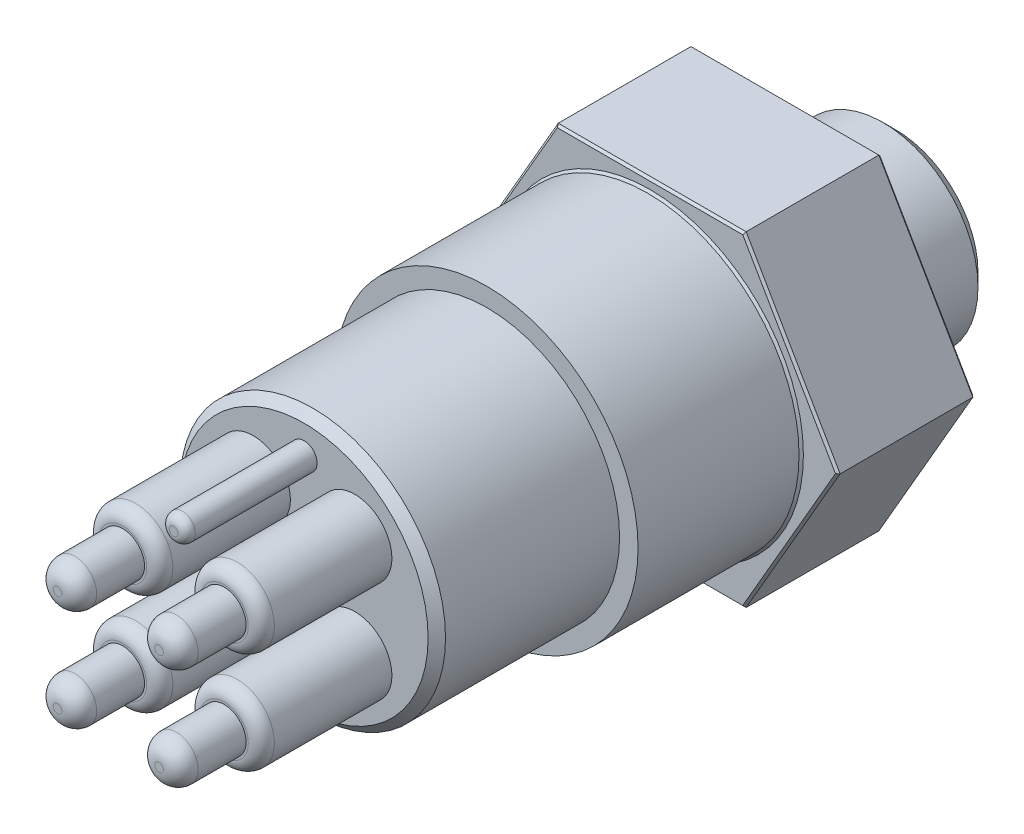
ISO-10303-21;
HEADER;
FILE_DESCRIPTION(('STEP AP214'),'2;1');
FILE_NAME('part.step','',(''),(''),'','','');
FILE_SCHEMA(('AUTOMOTIVE_DESIGN { 1 0 10303 214 1 1 1 1 }'));
ENDSEC;
DATA;
#1=APPLICATION_CONTEXT('core data for automotive mechanical design processes');
#2=APPLICATION_PROTOCOL_DEFINITION('international standard','automotive_design',2000,#1);
#3=PRODUCT_CONTEXT('',#1,'mechanical');
#4=PRODUCT('Part','Part','',(#3));
#5=PRODUCT_RELATED_PRODUCT_CATEGORY('part','',(#4));
#6=PRODUCT_DEFINITION_FORMATION('','',#4);
#7=PRODUCT_DEFINITION_CONTEXT('part definition',#1,'design');
#8=PRODUCT_DEFINITION('design','',#6,#7);
#9=PRODUCT_DEFINITION_SHAPE('','',#8);
#10=(LENGTH_UNIT() NAMED_UNIT(*) SI_UNIT(.MILLI.,.METRE.));
#11=(NAMED_UNIT(*) PLANE_ANGLE_UNIT() SI_UNIT($,.RADIAN.));
#12=(NAMED_UNIT(*) SI_UNIT($,.STERADIAN.) SOLID_ANGLE_UNIT());
#13=UNCERTAINTY_MEASURE_WITH_UNIT(LENGTH_MEASURE(1.E-05),#10,'distance_accuracy_value','');
#14=(GEOMETRIC_REPRESENTATION_CONTEXT(3) GLOBAL_UNCERTAINTY_ASSIGNED_CONTEXT((#13)) GLOBAL_UNIT_ASSIGNED_CONTEXT((#10,
#11,#12)) REPRESENTATION_CONTEXT('',''));
#15=CARTESIAN_POINT('',(0.,0.,0.));
#16=DIRECTION('',(0.,0.,1.));
#17=DIRECTION('',(1.,0.,0.));
#18=AXIS2_PLACEMENT_3D('',#15,#16,#17);
#19=CARTESIAN_POINT('',(2.96348451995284,-2.9634845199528,35.814));
#20=DIRECTION('',(0.,0.,1.));
#21=DIRECTION('',(1.,0.,0.));
#22=AXIS2_PLACEMENT_3D('',#19,#20,#21);
#23=PLANE('',#22);
#24=CARTESIAN_POINT('',(2.96348451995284,-2.9634845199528,35.814));
#25=DIRECTION('',(0.,0.,1.));
#26=DIRECTION('',(1.,0.,0.));
#27=AXIS2_PLACEMENT_3D('',#24,#25,#26);
#28=CIRCLE('',#27,1.397);
#29=CARTESIAN_POINT('',(4.36048451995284,-2.9634845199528,35.814));
#30=VERTEX_POINT('',#29);
#31=EDGE_CURVE('E253',#30,#30,#28,.T.);
#32=ORIENTED_EDGE('',*,*,#31,.T.);
#33=EDGE_LOOP('',(#32));
#34=FACE_BOUND('',#33,.T.);
#35=CARTESIAN_POINT('',(2.96348451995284,-2.9634845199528,35.814));
#36=DIRECTION('',(0.,0.,1.));
#37=DIRECTION('',(1.,0.,0.));
#38=AXIS2_PLACEMENT_3D('',#35,#36,#37);
#39=CIRCLE('',#38,1.27);
#40=CARTESIAN_POINT('',(1.69348451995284,-2.9634845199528,35.814));
#41=VERTEX_POINT('',#40);
#42=EDGE_CURVE('E449',#41,#41,#39,.T.);
#43=ORIENTED_EDGE('',*,*,#42,.F.);
#44=EDGE_LOOP('',(#43));
#45=FACE_BOUND('',#44,.T.);
#46=ADVANCED_FACE('F36',(#34,#45),#23,.T.);
#47=CARTESIAN_POINT('',(2.9634845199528,2.96348451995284,35.814));
#48=DIRECTION('',(0.,0.,1.));
#49=DIRECTION('',(1.,0.,0.));
#50=AXIS2_PLACEMENT_3D('',#47,#48,#49);
#51=PLANE('',#50);
#52=CARTESIAN_POINT('',(2.9634845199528,2.96348451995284,35.814));
#53=DIRECTION('',(0.,0.,1.));
#54=DIRECTION('',(1.,0.,0.));
#55=AXIS2_PLACEMENT_3D('',#52,#53,#54);
#56=CIRCLE('',#55,1.397);
#57=CARTESIAN_POINT('',(4.3604845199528,2.96348451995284,35.814));
#58=VERTEX_POINT('',#57);
#59=EDGE_CURVE('E259',#58,#58,#56,.T.);
#60=ORIENTED_EDGE('',*,*,#59,.T.);
#61=EDGE_LOOP('',(#60));
#62=FACE_BOUND('',#61,.T.);
#63=CARTESIAN_POINT('',(2.96348451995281,2.96348451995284,35.814));
#64=DIRECTION('',(0.,0.,1.));
#65=DIRECTION('',(1.,0.,0.));
#66=AXIS2_PLACEMENT_3D('',#63,#64,#65);
#67=CIRCLE('',#66,1.27);
#68=CARTESIAN_POINT('',(1.69348451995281,2.96348451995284,35.814));
#69=VERTEX_POINT('',#68);
#70=EDGE_CURVE('E446',#69,#69,#67,.T.);
#71=ORIENTED_EDGE('',*,*,#70,.F.);
#72=EDGE_LOOP('',(#71));
#73=FACE_BOUND('',#72,.T.);
#74=ADVANCED_FACE('F286',(#62,#73),#51,.T.);
#75=CARTESIAN_POINT('',(-2.9634845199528,-2.96348451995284,35.814));
#76=DIRECTION('',(0.,0.,1.));
#77=DIRECTION('',(1.,0.,0.));
#78=AXIS2_PLACEMENT_3D('',#75,#76,#77);
#79=PLANE('',#78);
#80=CARTESIAN_POINT('',(-2.9634845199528,-2.96348451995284,35.814));
#81=DIRECTION('',(0.,0.,1.));
#82=DIRECTION('',(1.,0.,0.));
#83=AXIS2_PLACEMENT_3D('',#80,#81,#82);
#84=CIRCLE('',#83,1.397);
#85=CARTESIAN_POINT('',(-1.5664845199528,-2.96348451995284,35.814));
#86=VERTEX_POINT('',#85);
#87=EDGE_CURVE('E265',#86,#86,#84,.T.);
#88=ORIENTED_EDGE('',*,*,#87,.T.);
#89=EDGE_LOOP('',(#88));
#90=FACE_BOUND('',#89,.T.);
#91=CARTESIAN_POINT('',(-2.96348451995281,-2.96348451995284,35.814));
#92=DIRECTION('',(0.,0.,1.));
#93=DIRECTION('',(1.,0.,0.));
#94=AXIS2_PLACEMENT_3D('',#91,#92,#93);
#95=CIRCLE('',#94,1.27);
#96=CARTESIAN_POINT('',(-4.23348451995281,-2.96348451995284,35.814));
#97=VERTEX_POINT('',#96);
#98=EDGE_CURVE('E448',#97,#97,#95,.T.);
#99=ORIENTED_EDGE('',*,*,#98,.F.);
#100=EDGE_LOOP('',(#99));
#101=FACE_BOUND('',#100,.T.);
#102=ADVANCED_FACE('F292',(#90,#101),#79,.T.);
#103=CARTESIAN_POINT('',(-2.96348451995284,2.9634845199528,35.814));
#104=DIRECTION('',(0.,0.,1.));
#105=DIRECTION('',(1.,0.,0.));
#106=AXIS2_PLACEMENT_3D('',#103,#104,#105);
#107=PLANE('',#106);
#108=CARTESIAN_POINT('',(-2.96348451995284,2.9634845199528,35.814));
#109=DIRECTION('',(0.,0.,1.));
#110=DIRECTION('',(1.,0.,0.));
#111=AXIS2_PLACEMENT_3D('',#108,#109,#110);
#112=CIRCLE('',#111,1.397);
#113=CARTESIAN_POINT('',(-1.56648451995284,2.9634845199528,35.814));
#114=VERTEX_POINT('',#113);
#115=EDGE_CURVE('E44',#114,#114,#112,.T.);
#116=ORIENTED_EDGE('',*,*,#115,.T.);
#117=EDGE_LOOP('',(#116));
#118=FACE_BOUND('',#117,.T.);
#119=CARTESIAN_POINT('',(-2.96348451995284,2.9634845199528,35.814));
#120=DIRECTION('',(0.,0.,1.));
#121=DIRECTION('',(1.,0.,0.));
#122=AXIS2_PLACEMENT_3D('',#119,#120,#121);
#123=CIRCLE('',#122,1.27);
#124=CARTESIAN_POINT('',(-4.23348451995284,2.9634845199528,35.814));
#125=VERTEX_POINT('',#124);
#126=EDGE_CURVE('E452',#125,#125,#123,.T.);
#127=ORIENTED_EDGE('',*,*,#126,.F.);
#128=EDGE_LOOP('',(#127));
#129=FACE_BOUND('',#128,.T.);
#130=ADVANCED_FACE('F273',(#118,#129),#107,.T.);
#131=CARTESIAN_POINT('',(0.,0.,28.194));
#132=DIRECTION('',(0.,0.,1.));
#133=DIRECTION('',(1.,0.,0.));
#134=AXIS2_PLACEMENT_3D('',#131,#132,#133);
#135=PLANE('',#134);
#136=CARTESIAN_POINT('',(-2.9634845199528,-2.96348451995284,28.194));
#137=DIRECTION('',(0.,0.,1.));
#138=DIRECTION('',(1.,0.,0.));
#139=AXIS2_PLACEMENT_3D('',#136,#137,#138);
#140=CIRCLE('',#139,2.159);
#141=CARTESIAN_POINT('',(-5.1224845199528,-2.96348451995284,28.194));
#142=VERTEX_POINT('',#141);
#143=EDGE_CURVE('E462',#142,#142,#140,.T.);
#144=ORIENTED_EDGE('',*,*,#143,.F.);
#145=EDGE_LOOP('',(#144));
#146=FACE_BOUND('',#145,.T.);
#147=CARTESIAN_POINT('',(0.,5.588,28.194));
#148=DIRECTION('',(0.,0.,1.));
#149=DIRECTION('',(1.,0.,0.));
#150=AXIS2_PLACEMENT_3D('',#147,#148,#149);
#151=CIRCLE('',#150,0.762);
#152=CARTESIAN_POINT('',(-0.762,5.588,28.194));
#153=VERTEX_POINT('',#152);
#154=EDGE_CURVE('E468',#153,#153,#151,.T.);
#155=ORIENTED_EDGE('',*,*,#154,.F.);
#156=EDGE_LOOP('',(#155));
#157=FACE_BOUND('',#156,.T.);
#158=CARTESIAN_POINT('',(0.,0.,28.194));
#159=DIRECTION('',(0.,0.,1.));
#160=DIRECTION('',(1.,0.,0.));
#161=AXIS2_PLACEMENT_3D('',#158,#159,#160);
#162=CIRCLE('',#161,7.239);
#163=CARTESIAN_POINT('',(7.239,0.,28.194));
#164=VERTEX_POINT('',#163);
#165=EDGE_CURVE('E192',#164,#164,#162,.T.);
#166=ORIENTED_EDGE('',*,*,#165,.T.);
#167=EDGE_LOOP('',(#166));
#168=FACE_BOUND('',#167,.T.);
#169=CARTESIAN_POINT('',(2.96348451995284,-2.9634845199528,28.194));
#170=DIRECTION('',(0.,0.,1.));
#171=DIRECTION('',(1.,0.,0.));
#172=AXIS2_PLACEMENT_3D('',#169,#170,#171);
#173=CIRCLE('',#172,2.159);
#174=CARTESIAN_POINT('',(0.804484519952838,-2.9634845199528,28.194));
#175=VERTEX_POINT('',#174);
#176=EDGE_CURVE('E471',#175,#175,#173,.T.);
#177=ORIENTED_EDGE('',*,*,#176,.F.);
#178=EDGE_LOOP('',(#177));
#179=FACE_BOUND('',#178,.T.);
#180=CARTESIAN_POINT('',(-2.96348451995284,2.9634845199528,28.194));
#181=DIRECTION('',(0.,0.,1.));
#182=DIRECTION('',(1.,0.,0.));
#183=AXIS2_PLACEMENT_3D('',#180,#181,#182);
#184=CIRCLE('',#183,2.159);
#185=CARTESIAN_POINT('',(-5.12248451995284,2.9634845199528,28.194));
#186=VERTEX_POINT('',#185);
#187=EDGE_CURVE('E465',#186,#186,#184,.T.);
#188=ORIENTED_EDGE('',*,*,#187,.F.);
#189=EDGE_LOOP('',(#188));
#190=FACE_BOUND('',#189,.T.);
#191=CARTESIAN_POINT('',(2.9634845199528,2.96348451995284,28.194));
#192=DIRECTION('',(0.,0.,1.));
#193=DIRECTION('',(1.,0.,0.));
#194=AXIS2_PLACEMENT_3D('',#191,#192,#193);
#195=CIRCLE('',#194,2.159);
#196=CARTESIAN_POINT('',(0.804484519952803,2.96348451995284,28.194));
#197=VERTEX_POINT('',#196);
#198=EDGE_CURVE('E459',#197,#197,#195,.T.);
#199=ORIENTED_EDGE('',*,*,#198,.F.);
#200=EDGE_LOOP('',(#199));
#201=FACE_BOUND('',#200,.T.);
#202=ADVANCED_FACE('F305',(#146,#157,#168,#179,#190,#201),#135,.T.);
#203=CARTESIAN_POINT('',(0.,0.,17.526));
#204=DIRECTION('',(0.,0.,1.));
#205=DIRECTION('',(1.,0.,0.));
#206=AXIS2_PLACEMENT_3D('',#203,#204,#205);
#207=PLANE('',#206);
#208=CARTESIAN_POINT('',(0.,0.,17.526));
#209=DIRECTION('',(0.,0.,1.));
#210=DIRECTION('',(1.,0.,0.));
#211=AXIS2_PLACEMENT_3D('',#208,#209,#210);
#212=CIRCLE('',#211,8.8265);
#213=CARTESIAN_POINT('',(-8.8265,0.,17.526));
#214=VERTEX_POINT('',#213);
#215=EDGE_CURVE('E205',#214,#214,#212,.T.);
#216=ORIENTED_EDGE('',*,*,#215,.T.);
#217=EDGE_LOOP('',(#216));
#218=FACE_BOUND('',#217,.T.);
#219=CARTESIAN_POINT('',(0.,0.,17.526));
#220=DIRECTION('',(0.,0.,1.));
#221=DIRECTION('',(1.,0.,0.));
#222=AXIS2_PLACEMENT_3D('',#219,#220,#221);
#223=CIRCLE('',#222,7.747);
#224=CARTESIAN_POINT('',(7.747,0.,17.526));
#225=VERTEX_POINT('',#224);
#226=EDGE_CURVE('E210',#225,#225,#223,.T.);
#227=ORIENTED_EDGE('',*,*,#226,.F.);
#228=EDGE_LOOP('',(#227));
#229=FACE_BOUND('',#228,.T.);
#230=ADVANCED_FACE('F308',(#218,#229),#207,.T.);
#231=CARTESIAN_POINT('',(5.48459661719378,9.4996,8.001));
#232=DIRECTION('',(0.,0.,-1.));
#233=DIRECTION('',(-1.,0.,0.));
#234=AXIS2_PLACEMENT_3D('',#231,#232,#233);
#235=PLANE('',#234);
#236=CARTESIAN_POINT('',(0.,0.,8.001));
#237=DIRECTION('',(0.,0.,-1.));
#238=DIRECTION('',(-1.,0.,0.));
#239=AXIS2_PLACEMENT_3D('',#236,#237,#238);
#240=CIRCLE('',#239,8.9535);
#241=CARTESIAN_POINT('',(-8.9535,0.,8.001));
#242=VERTEX_POINT('',#241);
#243=EDGE_CURVE('E151',#242,#242,#240,.T.);
#244=ORIENTED_EDGE('',*,*,#243,.T.);
#245=EDGE_LOOP('',(#244));
#246=FACE_BOUND('',#245,.T.);
#247=DIRECTION('',(0.5,0.866025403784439,0.));
#248=VECTOR('',#247,1.);
#249=CARTESIAN_POINT('',(13.6015063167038,4.8133,8.001));
#250=LINE('',#249,#248);
#251=CARTESIAN_POINT('',(5.41127313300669,-9.3726,8.001));
#252=VERTEX_POINT('',#251);
#253=CARTESIAN_POINT('',(10.8225462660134,0.,8.001));
#254=VERTEX_POINT('',#253);
#255=EDGE_CURVE('E149',#252,#254,#250,.T.);
#256=ORIENTED_EDGE('',*,*,#255,.T.);
#257=DIRECTION('',(-0.5,0.866025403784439,0.));
#258=VECTOR('',#257,1.);
#259=CARTESIAN_POINT('',(5.37461139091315,9.4361,8.001));
#260=LINE('',#259,#258);
#261=CARTESIAN_POINT('',(5.41127313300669,9.37260000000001,8.001));
#262=VERTEX_POINT('',#261);
#263=EDGE_CURVE('E129',#254,#262,#260,.T.);
#264=ORIENTED_EDGE('',*,*,#263,.T.);
#265=DIRECTION('',(-1.,0.,0.));
#266=VECTOR('',#265,1.);
#267=CARTESIAN_POINT('',(5.48459661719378,9.37260000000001,8.001));
#268=LINE('',#267,#266);
#269=CARTESIAN_POINT('',(-5.41127313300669,9.3726,8.001));
#270=VERTEX_POINT('',#269);
#271=EDGE_CURVE('E138',#262,#270,#268,.T.);
#272=ORIENTED_EDGE('',*,*,#271,.T.);
#273=DIRECTION('',(-0.5,-0.866025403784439,0.));
#274=VECTOR('',#273,1.);
#275=CARTESIAN_POINT('',(-2.63231308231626,14.1859,8.001));
#276=LINE('',#275,#274);
#277=CARTESIAN_POINT('',(-10.8225462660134,0.,8.001));
#278=VERTEX_POINT('',#277);
#279=EDGE_CURVE('E144',#270,#278,#276,.T.);
#280=ORIENTED_EDGE('',*,*,#279,.T.);
#281=DIRECTION('',(0.5,-0.866025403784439,0.));
#282=VECTOR('',#281,1.);
#283=CARTESIAN_POINT('',(-10.8592080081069,0.0634999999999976,8.001));
#284=LINE('',#283,#282);
#285=CARTESIAN_POINT('',(-5.41127313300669,-9.3726,8.001));
#286=VERTEX_POINT('',#285);
#287=EDGE_CURVE('E511',#278,#286,#284,.T.);
#288=ORIENTED_EDGE('',*,*,#287,.T.);
#289=DIRECTION('',(1.,0.,0.));
#290=VECTOR('',#289,1.);
#291=CARTESIAN_POINT('',(5.48459661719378,-9.3726,8.001));
#292=LINE('',#291,#290);
#293=EDGE_CURVE('E156',#286,#252,#292,.T.);
#294=ORIENTED_EDGE('',*,*,#293,.T.);
#295=EDGE_LOOP('',(#256,#264,#272,#280,#288,#294));
#296=FACE_BOUND('',#295,.T.);
#297=ADVANCED_FACE('F147',(#246,#296),#235,.F.);
#298=CARTESIAN_POINT('',(0.,0.,-6.35));
#299=DIRECTION('',(0.,0.,1.));
#300=DIRECTION('',(1.,0.,0.));
#301=AXIS2_PLACEMENT_3D('',#298,#299,#300);
#302=CYLINDRICAL_SURFACE('',#301,5.55625);
#303=CARTESIAN_POINT('',(0.,0.,-5.588));
#304=DIRECTION('',(0.,0.,1.));
#305=DIRECTION('',(1.,0.,0.));
#306=AXIS2_PLACEMENT_3D('',#303,#304,#305);
#307=CIRCLE('',#306,5.55625);
#308=CARTESIAN_POINT('',(5.55625,0.,-5.588));
#309=VERTEX_POINT('',#308);
#310=EDGE_CURVE('E502',#309,#309,#307,.T.);
#311=ORIENTED_EDGE('',*,*,#310,.T.);
#312=EDGE_LOOP('',(#311));
#313=FACE_BOUND('',#312,.T.);
#314=CARTESIAN_POINT('',(0.,0.,0.));
#315=DIRECTION('',(0.,0.,1.));
#316=DIRECTION('',(1.,0.,0.));
#317=AXIS2_PLACEMENT_3D('',#314,#315,#316);
#318=CIRCLE('',#317,5.55625);
#319=CARTESIAN_POINT('',(5.55625,0.,0.));
#320=VERTEX_POINT('',#319);
#321=EDGE_CURVE('E499',#320,#320,#318,.T.);
#322=ORIENTED_EDGE('',*,*,#321,.F.);
#323=EDGE_LOOP('',(#322));
#324=FACE_BOUND('',#323,.T.);
#325=ADVANCED_FACE('F326',(#313,#324),#302,.T.);
#326=CARTESIAN_POINT('',(0.,0.,-6.35));
#327=DIRECTION('',(0.,0.,1.));
#328=DIRECTION('',(1.,0.,0.));
#329=AXIS2_PLACEMENT_3D('',#326,#327,#328);
#330=PLANE('',#329);
#331=CARTESIAN_POINT('',(0.,0.,-6.35));
#332=DIRECTION('',(0.,0.,1.));
#333=DIRECTION('',(1.,0.,0.));
#334=AXIS2_PLACEMENT_3D('',#331,#332,#333);
#335=CIRCLE('',#334,4.79425);
#336=CARTESIAN_POINT('',(4.79425,0.,-6.35));
#337=VERTEX_POINT('',#336);
#338=EDGE_CURVE('E505',#337,#337,#335,.F.);
#339=ORIENTED_EDGE('',*,*,#338,.T.);
#340=EDGE_LOOP('',(#339));
#341=FACE_BOUND('',#340,.T.);
#342=ADVANCED_FACE('F356',(#341),#330,.F.);
#343=CARTESIAN_POINT('',(0.,0.,-5.588));
#344=DIRECTION('',(0.,0.,1.));
#345=DIRECTION('',(1.,0.,0.));
#346=AXIS2_PLACEMENT_3D('',#343,#344,#345);
#347=CONICAL_SURFACE('',#346,5.55625,0.785398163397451);
#348=ORIENTED_EDGE('',*,*,#338,.F.);
#349=EDGE_LOOP('',(#348));
#350=FACE_BOUND('',#349,.T.);
#351=ORIENTED_EDGE('',*,*,#310,.F.);
#352=EDGE_LOOP('',(#351));
#353=FACE_BOUND('',#352,.T.);
#354=ADVANCED_FACE('F354',(#350,#353),#347,.T.);
#355=CARTESIAN_POINT('',(5.48459661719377,9.4996,8.001));
#356=DIRECTION('',(0.,-1.,0.));
#357=DIRECTION('',(1.,0.,0.));
#358=AXIS2_PLACEMENT_3D('',#355,#356,#357);
#359=PLANE('',#358);
#360=DIRECTION('',(0.,0.,-1.));
#361=VECTOR('',#360,1.);
#362=CARTESIAN_POINT('',(-5.48459661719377,9.4996,8.001));
#363=LINE('',#362,#361);
#364=CARTESIAN_POINT('',(-5.48459661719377,9.4996,7.874));
#365=VERTEX_POINT('',#364);
#366=CARTESIAN_POINT('',(-5.48459661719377,9.4996,0.126999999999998));
#367=VERTEX_POINT('',#366);
#368=EDGE_CURVE('E496',#365,#367,#363,.T.);
#369=ORIENTED_EDGE('',*,*,#368,.F.);
#370=DIRECTION('',(1.,0.,0.));
#371=VECTOR('',#370,1.);
#372=CARTESIAN_POINT('',(5.48459661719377,9.4996,7.874));
#373=LINE('',#372,#371);
#374=CARTESIAN_POINT('',(5.48459661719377,9.4996,7.874));
#375=VERTEX_POINT('',#374);
#376=EDGE_CURVE('E183',#365,#375,#373,.T.);
#377=ORIENTED_EDGE('',*,*,#376,.T.);
#378=DIRECTION('',(0.,0.,-1.));
#379=VECTOR('',#378,1.);
#380=CARTESIAN_POINT('',(5.48459661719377,9.4996,8.001));
#381=LINE('',#380,#379);
#382=CARTESIAN_POINT('',(5.48459661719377,9.4996,0.127));
#383=VERTEX_POINT('',#382);
#384=EDGE_CURVE('E481',#375,#383,#381,.T.);
#385=ORIENTED_EDGE('',*,*,#384,.T.);
#386=DIRECTION('',(-1.,0.,0.));
#387=VECTOR('',#386,1.);
#388=CARTESIAN_POINT('',(-5.48459661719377,9.4996,0.127));
#389=LINE('',#388,#387);
#390=EDGE_CURVE('E180',#383,#367,#389,.T.);
#391=ORIENTED_EDGE('',*,*,#390,.T.);
#392=EDGE_LOOP('',(#369,#377,#385,#391));
#393=FACE_BOUND('',#392,.T.);
#394=ADVANCED_FACE('F350',(#393),#359,.F.);
#395=CARTESIAN_POINT('',(-5.48459661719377,9.4996,8.001));
#396=DIRECTION('',(0.866025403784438,-0.5,0.));
#397=DIRECTION('',(0.5,0.866025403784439,0.));
#398=AXIS2_PLACEMENT_3D('',#395,#396,#397);
#399=PLANE('',#398);
#400=DIRECTION('',(0.,0.,-1.));
#401=VECTOR('',#400,1.);
#402=CARTESIAN_POINT('',(-10.9691932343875,0.,8.001));
#403=LINE('',#402,#401);
#404=CARTESIAN_POINT('',(-10.9691932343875,0.,7.874));
#405=VERTEX_POINT('',#404);
#406=CARTESIAN_POINT('',(-10.9691932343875,0.,0.127000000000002));
#407=VERTEX_POINT('',#406);
#408=EDGE_CURVE('E493',#405,#407,#403,.T.);
#409=ORIENTED_EDGE('',*,*,#408,.F.);
#410=DIRECTION('',(0.5,0.866025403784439,0.));
#411=VECTOR('',#410,1.);
#412=CARTESIAN_POINT('',(-5.48459661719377,9.4996,7.874));
#413=LINE('',#412,#411);
#414=EDGE_CURVE('E178',#405,#365,#413,.T.);
#415=ORIENTED_EDGE('',*,*,#414,.T.);
#416=ORIENTED_EDGE('',*,*,#368,.T.);
#417=DIRECTION('',(-0.377964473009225,-0.654653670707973,-0.654653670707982));
#418=VECTOR('',#417,1.);
#419=CARTESIAN_POINT('',(-3.91756901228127,12.2137714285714,2.84117142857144));
#420=LINE('',#419,#418);
#421=CARTESIAN_POINT('',(-5.55792010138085,9.3726,0.));
#422=VERTEX_POINT('',#421);
#423=EDGE_CURVE('E176',#367,#422,#420,.T.);
#424=ORIENTED_EDGE('',*,*,#423,.T.);
#425=DIRECTION('',(-0.5,-0.866025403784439,0.));
#426=VECTOR('',#425,1.);
#427=CARTESIAN_POINT('',(-5.48459661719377,9.4996,0.));
#428=LINE('',#427,#426);
#429=CARTESIAN_POINT('',(-10.8958697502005,0.127000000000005,0.));
#430=VERTEX_POINT('',#429);
#431=EDGE_CURVE('E478',#422,#430,#428,.T.);
#432=ORIENTED_EDGE('',*,*,#431,.T.);
#433=DIRECTION('',(-0.377964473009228,-0.654653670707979,0.654653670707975));
#434=VECTOR('',#433,1.);
#435=CARTESIAN_POINT('',(-10.9691932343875,0.,0.127000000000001));
#436=LINE('',#435,#434);
#437=EDGE_CURVE('E174',#430,#407,#436,.T.);
#438=ORIENTED_EDGE('',*,*,#437,.T.);
#439=EDGE_LOOP('',(#409,#415,#416,#424,#432,#438));
#440=FACE_BOUND('',#439,.T.);
#441=ADVANCED_FACE('F346',(#440),#399,.F.);
#442=CARTESIAN_POINT('',(-10.9691932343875,0.,8.001));
#443=DIRECTION('',(0.866025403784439,0.5,0.));
#444=DIRECTION('',(-0.5,0.866025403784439,0.));
#445=AXIS2_PLACEMENT_3D('',#442,#443,#444);
#446=PLANE('',#445);
#447=DIRECTION('',(0.,0.,-1.));
#448=VECTOR('',#447,1.);
#449=CARTESIAN_POINT('',(-5.48459661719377,-9.4996,8.001));
#450=LINE('',#449,#448);
#451=CARTESIAN_POINT('',(-5.48459661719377,-9.4996,7.874));
#452=VERTEX_POINT('',#451);
#453=CARTESIAN_POINT('',(-5.48459661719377,-9.4996,0.127));
#454=VERTEX_POINT('',#453);
#455=EDGE_CURVE('E490',#452,#454,#450,.T.);
#456=ORIENTED_EDGE('',*,*,#455,.F.);
#457=DIRECTION('',(-0.5,0.866025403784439,0.));
#458=VECTOR('',#457,1.);
#459=CARTESIAN_POINT('',(-10.9691932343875,0.,7.874));
#460=LINE('',#459,#458);
#461=EDGE_CURVE('E172',#452,#405,#460,.T.);
#462=ORIENTED_EDGE('',*,*,#461,.T.);
#463=ORIENTED_EDGE('',*,*,#408,.T.);
#464=DIRECTION('',(0.5,-0.866025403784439,0.));
#465=VECTOR('',#464,1.);
#466=CARTESIAN_POINT('',(-5.48459661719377,-9.4996,0.127));
#467=LINE('',#466,#465);
#468=EDGE_CURVE('E170',#407,#454,#467,.T.);
#469=ORIENTED_EDGE('',*,*,#468,.T.);
#470=EDGE_LOOP('',(#456,#462,#463,#469));
#471=FACE_BOUND('',#470,.T.);
#472=ADVANCED_FACE('F342',(#471),#446,.F.);
#473=CARTESIAN_POINT('',(-5.48459661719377,-9.4996,8.001));
#474=DIRECTION('',(0.,1.,0.));
#475=DIRECTION('',(-1.,0.,0.));
#476=AXIS2_PLACEMENT_3D('',#473,#474,#475);
#477=PLANE('',#476);
#478=DIRECTION('',(0.,0.,-1.));
#479=VECTOR('',#478,1.);
#480=CARTESIAN_POINT('',(5.48459661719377,-9.4996,8.001));
#481=LINE('',#480,#479);
#482=CARTESIAN_POINT('',(5.48459661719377,-9.4996,7.874));
#483=VERTEX_POINT('',#482);
#484=CARTESIAN_POINT('',(5.48459661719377,-9.4996,0.127));
#485=VERTEX_POINT('',#484);
#486=EDGE_CURVE('E487',#483,#485,#481,.T.);
#487=ORIENTED_EDGE('',*,*,#486,.F.);
#488=DIRECTION('',(-1.,0.,0.));
#489=VECTOR('',#488,1.);
#490=CARTESIAN_POINT('',(-5.48459661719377,-9.4996,7.874));
#491=LINE('',#490,#489);
#492=EDGE_CURVE('E168',#483,#452,#491,.T.);
#493=ORIENTED_EDGE('',*,*,#492,.T.);
#494=ORIENTED_EDGE('',*,*,#455,.T.);
#495=DIRECTION('',(1.,0.,0.));
#496=VECTOR('',#495,1.);
#497=CARTESIAN_POINT('',(5.48459661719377,-9.4996,0.127));
#498=LINE('',#497,#496);
#499=EDGE_CURVE('E166',#454,#485,#498,.T.);
#500=ORIENTED_EDGE('',*,*,#499,.T.);
#501=EDGE_LOOP('',(#487,#493,#494,#500));
#502=FACE_BOUND('',#501,.T.);
#503=ADVANCED_FACE('F338',(#502),#477,.F.);
#504=CARTESIAN_POINT('',(5.48459661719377,-9.4996,8.001));
#505=DIRECTION('',(-0.866025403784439,0.5,0.));
#506=DIRECTION('',(-0.5,-0.866025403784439,0.));
#507=AXIS2_PLACEMENT_3D('',#504,#505,#506);
#508=PLANE('',#507);
#509=DIRECTION('',(0.,0.,-1.));
#510=VECTOR('',#509,1.);
#511=CARTESIAN_POINT('',(10.9691932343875,0.,8.001));
#512=LINE('',#511,#510);
#513=CARTESIAN_POINT('',(10.9691932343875,0.,7.874));
#514=VERTEX_POINT('',#513);
#515=CARTESIAN_POINT('',(10.9691932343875,0.,0.127));
#516=VERTEX_POINT('',#515);
#517=EDGE_CURVE('E484',#514,#516,#512,.T.);
#518=ORIENTED_EDGE('',*,*,#517,.F.);
#519=DIRECTION('',(-0.5,-0.866025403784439,0.));
#520=VECTOR('',#519,1.);
#521=CARTESIAN_POINT('',(5.48459661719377,-9.4996,7.874));
#522=LINE('',#521,#520);
#523=EDGE_CURVE('E164',#514,#483,#522,.T.);
#524=ORIENTED_EDGE('',*,*,#523,.T.);
#525=ORIENTED_EDGE('',*,*,#486,.T.);
#526=DIRECTION('',(0.5,0.866025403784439,0.));
#527=VECTOR('',#526,1.);
#528=CARTESIAN_POINT('',(10.9691932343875,0.,0.127));
#529=LINE('',#528,#527);
#530=EDGE_CURVE('E162',#485,#516,#529,.T.);
#531=ORIENTED_EDGE('',*,*,#530,.T.);
#532=EDGE_LOOP('',(#518,#524,#525,#531));
#533=FACE_BOUND('',#532,.T.);
#534=ADVANCED_FACE('F334',(#533),#508,.F.);
#535=CARTESIAN_POINT('',(10.9691932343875,0.,8.001));
#536=DIRECTION('',(-0.866025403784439,-0.5,0.));
#537=DIRECTION('',(0.5,-0.866025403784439,0.));
#538=AXIS2_PLACEMENT_3D('',#535,#536,#537);
#539=PLANE('',#538);
#540=ORIENTED_EDGE('',*,*,#384,.F.);
#541=DIRECTION('',(0.5,-0.866025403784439,0.));
#542=VECTOR('',#541,1.);
#543=CARTESIAN_POINT('',(10.9691932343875,0.,7.874));
#544=LINE('',#543,#542);
#545=EDGE_CURVE('E131',#375,#514,#544,.T.);
#546=ORIENTED_EDGE('',*,*,#545,.T.);
#547=ORIENTED_EDGE('',*,*,#517,.T.);
#548=DIRECTION('',(-0.5,0.866025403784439,0.));
#549=VECTOR('',#548,1.);
#550=CARTESIAN_POINT('',(5.48459661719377,9.4996,0.127000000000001));
#551=LINE('',#550,#549);
#552=EDGE_CURVE('E154',#516,#383,#551,.T.);
#553=ORIENTED_EDGE('',*,*,#552,.T.);
#554=EDGE_LOOP('',(#540,#546,#547,#553));
#555=FACE_BOUND('',#554,.T.);
#556=ADVANCED_FACE('F330',(#555),#539,.F.);
#557=CARTESIAN_POINT('',(5.48459661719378,9.4996,0.));
#558=DIRECTION('',(0.,0.,-1.));
#559=DIRECTION('',(-1.,0.,0.));
#560=AXIS2_PLACEMENT_3D('',#557,#558,#559);
#561=PLANE('',#560);
#562=ORIENTED_EDGE('',*,*,#321,.T.);
#563=EDGE_LOOP('',(#562));
#564=FACE_BOUND('',#563,.T.);
#565=ORIENTED_EDGE('',*,*,#431,.F.);
#566=DIRECTION('',(1.,0.,0.));
#567=VECTOR('',#566,1.);
#568=CARTESIAN_POINT('',(5.48459661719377,9.37260000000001,0.));
#569=LINE('',#568,#567);
#570=CARTESIAN_POINT('',(5.41127313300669,9.37260000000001,0.));
#571=VERTEX_POINT('',#570);
#572=EDGE_CURVE('E51',#422,#571,#569,.T.);
#573=ORIENTED_EDGE('',*,*,#572,.T.);
#574=DIRECTION('',(0.5,-0.866025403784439,0.));
#575=VECTOR('',#574,1.);
#576=CARTESIAN_POINT('',(10.8592080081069,-0.0634999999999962,0.));
#577=LINE('',#576,#575);
#578=CARTESIAN_POINT('',(10.8225462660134,0.,0.));
#579=VERTEX_POINT('',#578);
#580=EDGE_CURVE('E55',#571,#579,#577,.T.);
#581=ORIENTED_EDGE('',*,*,#580,.T.);
#582=DIRECTION('',(-0.5,-0.866025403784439,0.));
#583=VECTOR('',#582,1.);
#584=CARTESIAN_POINT('',(5.37461139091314,-9.43609999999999,0.));
#585=LINE('',#584,#583);
#586=CARTESIAN_POINT('',(5.41127313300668,-9.3726,0.));
#587=VERTEX_POINT('',#586);
#588=EDGE_CURVE('E189',#579,#587,#585,.T.);
#589=ORIENTED_EDGE('',*,*,#588,.T.);
#590=DIRECTION('',(-1.,0.,0.));
#591=VECTOR('',#590,1.);
#592=CARTESIAN_POINT('',(-5.48459661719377,-9.3726,0.));
#593=LINE('',#592,#591);
#594=CARTESIAN_POINT('',(-5.41127313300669,-9.3726,0.));
#595=VERTEX_POINT('',#594);
#596=EDGE_CURVE('E187',#587,#595,#593,.T.);
#597=ORIENTED_EDGE('',*,*,#596,.T.);
#598=DIRECTION('',(-0.5,0.866025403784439,0.));
#599=VECTOR('',#598,1.);
#600=CARTESIAN_POINT('',(-10.8592080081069,0.0635000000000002,0.));
#601=LINE('',#600,#599);
#602=EDGE_CURVE('E185',#595,#430,#601,.T.);
#603=ORIENTED_EDGE('',*,*,#602,.T.);
#604=EDGE_LOOP('',(#565,#573,#581,#589,#597,#603));
#605=FACE_BOUND('',#604,.T.);
#606=ADVANCED_FACE('F322',(#564,#605),#561,.T.);
#607=CARTESIAN_POINT('',(0.,0.,17.526));
#608=DIRECTION('',(0.,0.,-1.));
#609=DIRECTION('',(-1.,0.,0.));
#610=AXIS2_PLACEMENT_3D('',#607,#608,#609);
#611=CYLINDRICAL_SURFACE('',#610,8.8265);
#612=CARTESIAN_POINT('',(0.,0.,8.12800000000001));
#613=DIRECTION('',(0.,0.,-1.));
#614=DIRECTION('',(-1.,0.,0.));
#615=AXIS2_PLACEMENT_3D('',#612,#613,#614);
#616=CIRCLE('',#615,8.8265);
#617=CARTESIAN_POINT('',(-8.8265,0.,8.12800000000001));
#618=VERTEX_POINT('',#617);
#619=EDGE_CURVE('E145',#618,#618,#616,.F.);
#620=CARTESIAN_POINT('',(-8.8265,0.,8.12800000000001));
#621=CARTESIAN_POINT('',(-8.8265,0.,8.22589583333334));
#622=CARTESIAN_POINT('',(-8.8265,0.,8.32379166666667));
#623=CARTESIAN_POINT('',(-8.8265,0.,8.51958333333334));
#624=CARTESIAN_POINT('',(-8.8265,0.,8.61747916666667));
#625=CARTESIAN_POINT('',(-8.8265,0.,8.81327083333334));
#626=CARTESIAN_POINT('',(-8.8265,0.,8.91116666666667));
#627=CARTESIAN_POINT('',(-8.8265,0.,9.10695833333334));
#628=CARTESIAN_POINT('',(-8.8265,0.,9.20485416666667));
#629=CARTESIAN_POINT('',(-8.8265,0.,9.40064583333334));
#630=CARTESIAN_POINT('',(-8.8265,0.,9.49854166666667));
#631=CARTESIAN_POINT('',(-8.8265,0.,9.69433333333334));
#632=CARTESIAN_POINT('',(-8.8265,0.,9.79222916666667));
#633=CARTESIAN_POINT('',(-8.8265,0.,9.98802083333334));
#634=CARTESIAN_POINT('',(-8.8265,0.,10.0859166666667));
#635=CARTESIAN_POINT('',(-8.8265,0.,10.2817083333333));
#636=CARTESIAN_POINT('',(-8.8265,0.,10.3796041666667));
#637=CARTESIAN_POINT('',(-8.8265,0.,10.5753958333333));
#638=CARTESIAN_POINT('',(-8.8265,0.,10.6732916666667));
#639=CARTESIAN_POINT('',(-8.8265,0.,10.8690833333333));
#640=CARTESIAN_POINT('',(-8.8265,0.,10.9669791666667));
#641=CARTESIAN_POINT('',(-8.8265,0.,11.1627708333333));
#642=CARTESIAN_POINT('',(-8.8265,0.,11.2606666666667));
#643=CARTESIAN_POINT('',(-8.8265,0.,11.4564583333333));
#644=CARTESIAN_POINT('',(-8.8265,0.,11.5543541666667));
#645=CARTESIAN_POINT('',(-8.8265,0.,11.7501458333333));
#646=CARTESIAN_POINT('',(-8.8265,0.,11.8480416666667));
#647=CARTESIAN_POINT('',(-8.8265,0.,12.0438333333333));
#648=CARTESIAN_POINT('',(-8.8265,0.,12.1417291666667));
#649=CARTESIAN_POINT('',(-8.8265,0.,12.3375208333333));
#650=CARTESIAN_POINT('',(-8.8265,0.,12.4354166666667));
#651=CARTESIAN_POINT('',(-8.8265,0.,12.6312083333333));
#652=CARTESIAN_POINT('',(-8.8265,0.,12.7291041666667));
#653=CARTESIAN_POINT('',(-8.8265,0.,12.9248958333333));
#654=CARTESIAN_POINT('',(-8.8265,0.,13.0227916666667));
#655=CARTESIAN_POINT('',(-8.8265,0.,13.2185833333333));
#656=CARTESIAN_POINT('',(-8.8265,0.,13.3164791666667));
#657=CARTESIAN_POINT('',(-8.8265,0.,13.5122708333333));
#658=CARTESIAN_POINT('',(-8.8265,0.,13.6101666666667));
#659=CARTESIAN_POINT('',(-8.8265,0.,13.8059583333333));
#660=CARTESIAN_POINT('',(-8.8265,0.,13.9038541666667));
#661=CARTESIAN_POINT('',(-8.8265,0.,14.0996458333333));
#662=CARTESIAN_POINT('',(-8.8265,0.,14.1975416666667));
#663=CARTESIAN_POINT('',(-8.8265,0.,14.3933333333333));
#664=CARTESIAN_POINT('',(-8.8265,0.,14.4912291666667));
#665=CARTESIAN_POINT('',(-8.8265,0.,14.6870208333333));
#666=CARTESIAN_POINT('',(-8.8265,0.,14.7849166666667));
#667=CARTESIAN_POINT('',(-8.8265,0.,14.9807083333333));
#668=CARTESIAN_POINT('',(-8.8265,0.,15.0786041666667));
#669=CARTESIAN_POINT('',(-8.8265,0.,15.2743958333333));
#670=CARTESIAN_POINT('',(-8.8265,0.,15.3722916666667));
#671=CARTESIAN_POINT('',(-8.8265,0.,15.5680833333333));
#672=CARTESIAN_POINT('',(-8.8265,0.,15.6659791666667));
#673=CARTESIAN_POINT('',(-8.8265,0.,15.8617708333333));
#674=CARTESIAN_POINT('',(-8.8265,0.,15.9596666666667));
#675=CARTESIAN_POINT('',(-8.8265,0.,16.1554583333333));
#676=CARTESIAN_POINT('',(-8.8265,0.,16.2533541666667));
#677=CARTESIAN_POINT('',(-8.8265,0.,16.4491458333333));
#678=CARTESIAN_POINT('',(-8.8265,0.,16.5470416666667));
#679=CARTESIAN_POINT('',(-8.8265,0.,16.7428333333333));
#680=CARTESIAN_POINT('',(-8.8265,0.,16.8407291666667));
#681=CARTESIAN_POINT('',(-8.8265,0.,17.0365208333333));
#682=CARTESIAN_POINT('',(-8.8265,0.,17.1344166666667));
#683=CARTESIAN_POINT('',(-8.8265,0.,17.3302083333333));
#684=CARTESIAN_POINT('',(-8.8265,0.,17.4281041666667));
#685=CARTESIAN_POINT('',(-8.8265,0.,17.526));
#686=B_SPLINE_CURVE_WITH_KNOTS('',3,(#620,#621,#622,#623,#624,#625,#626,#627,#628,#629,#630,
#631,#632,#633,#634,#635,#636,#637,#638,#639,#640,#641,#642,#643,#644,#645,#646,#647,#648,#649,
#650,#651,#652,#653,#654,#655,#656,#657,#658,#659,#660,#661,#662,#663,#664,#665,#666,#667,#668,
#669,#670,#671,#672,#673,#674,#675,#676,#677,#678,#679,#680,#681,#682,#683,#684,#685),
.UNSPECIFIED.,.F.,.F.,(4,2,2,2,2,2,2,2,2,2,2,2,2,2,2,2,2,2,2,2,2,2,2,2,2,2,2,2,2,2,2,2,4),(0.,
0.293687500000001,0.587374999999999,0.8810625,1.17475,1.4684375,1.762125,2.0558125,2.3495,
2.6431875,2.936875,3.2305625,3.52425,3.8179375,4.111625,4.4053125,4.699,4.9926875,5.286375,
5.5800625,5.87374999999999,6.1674375,6.46112499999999,6.7548125,7.04849999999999,
7.34218749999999,7.635875,7.9295625,8.22325,8.51693749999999,8.81062499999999,9.10431249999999,
9.39799999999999),.UNSPECIFIED.);
#687=EDGE_CURVE('BSEAM318',#618,#214,#686,.T.);
#688=ORIENTED_EDGE('',*,*,#619,.T.);
#689=ORIENTED_EDGE('',*,*,#215,.F.);
#690=ORIENTED_EDGE('',*,*,#687,.T.);
#691=ORIENTED_EDGE('',*,*,#687,.F.);
#692=EDGE_LOOP('',(#688,#690,#689,#691));
#693=FACE_BOUND('',#692,.T.);
#694=ADVANCED_FACE('F318',(#693),#611,.T.);
#695=CARTESIAN_POINT('',(0.,0.,8.12800000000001));
#696=DIRECTION('',(0.,0.,-1.));
#697=DIRECTION('',(-1.,0.,0.));
#698=AXIS2_PLACEMENT_3D('',#695,#696,#697);
#699=CONICAL_SURFACE('',#698,8.8265,0.785398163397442);
#700=ORIENTED_EDGE('',*,*,#243,.F.);
#701=EDGE_LOOP('',(#700));
#702=FACE_BOUND('',#701,.T.);
#703=ORIENTED_EDGE('',*,*,#619,.F.);
#704=EDGE_LOOP('',(#703));
#705=FACE_BOUND('',#704,.T.);
#706=ADVANCED_FACE('F321',(#702,#705),#699,.T.);
#707=CARTESIAN_POINT('',(-10.8592080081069,0.0634999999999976,8.001));
#708=DIRECTION('',(0.612372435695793,0.353553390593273,-0.707106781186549));
#709=DIRECTION('',(-0.755928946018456,0.,-0.654653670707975));
#710=AXIS2_PLACEMENT_3D('',#707,#708,#709);
#711=PLANE('',#710);
#712=DIRECTION('',(0.755928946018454,0.,0.654653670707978));
#713=VECTOR('',#712,1.);
#714=CARTESIAN_POINT('',(-6.14241301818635,0.,12.0541142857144));
#715=LINE('',#714,#713);
#716=EDGE_CURVE('E199',#405,#278,#715,.T.);
#717=ORIENTED_EDGE('',*,*,#716,.F.);
#718=ORIENTED_EDGE('',*,*,#461,.F.);
#719=DIRECTION('',(0.377964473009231,0.654653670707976,0.654653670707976));
#720=VECTOR('',#719,1.);
#721=CARTESIAN_POINT('',(-3.85472031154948,-6.67657142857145,10.6970285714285));
#722=LINE('',#721,#720);
#723=EDGE_CURVE('E202',#286,#452,#722,.F.);
#724=ORIENTED_EDGE('',*,*,#723,.F.);
#725=ORIENTED_EDGE('',*,*,#287,.F.);
#726=EDGE_LOOP('',(#717,#718,#724,#725));
#727=FACE_BOUND('',#726,.T.);
#728=ADVANCED_FACE('F368',(#727),#711,.F.);
#729=CARTESIAN_POINT('',(5.48459661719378,-9.3726,8.001));
#730=DIRECTION('',(0.,0.707106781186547,-0.707106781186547));
#731=DIRECTION('',(0.,0.707106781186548,0.707106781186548));
#732=AXIS2_PLACEMENT_3D('',#729,#730,#731);
#733=PLANE('',#732);
#734=ORIENTED_EDGE('',*,*,#723,.T.);
#735=ORIENTED_EDGE('',*,*,#492,.F.);
#736=DIRECTION('',(-0.377964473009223,0.654653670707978,0.654653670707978));
#737=VECTOR('',#736,1.);
#738=CARTESIAN_POINT('',(5.42174791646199,-9.39074285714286,7.98285714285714));
#739=LINE('',#738,#737);
#740=EDGE_CURVE('E196',#252,#483,#739,.F.);
#741=ORIENTED_EDGE('',*,*,#740,.F.);
#742=ORIENTED_EDGE('',*,*,#293,.F.);
#743=EDGE_LOOP('',(#734,#735,#741,#742));
#744=FACE_BOUND('',#743,.T.);
#745=ADVANCED_FACE('F382',(#744),#733,.F.);
#746=CARTESIAN_POINT('',(-2.63231308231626,14.1859,8.001));
#747=DIRECTION('',(0.612372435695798,-0.353553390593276,-0.707106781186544));
#748=DIRECTION('',(-0.755928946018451,0.,-0.654653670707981));
#749=AXIS2_PLACEMENT_3D('',#746,#747,#748);
#750=PLANE('',#749);
#751=ORIENTED_EDGE('',*,*,#716,.T.);
#752=ORIENTED_EDGE('',*,*,#279,.F.);
#753=DIRECTION('',(0.377964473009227,-0.654653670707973,0.654653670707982));
#754=VECTOR('',#753,1.);
#755=CARTESIAN_POINT('',(-3.85472031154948,6.67657142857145,10.6970285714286));
#756=LINE('',#755,#754);
#757=EDGE_CURVE('E141',#365,#270,#756,.T.);
#758=ORIENTED_EDGE('',*,*,#757,.F.);
#759=ORIENTED_EDGE('',*,*,#414,.F.);
#760=EDGE_LOOP('',(#751,#752,#758,#759));
#761=FACE_BOUND('',#760,.T.);
#762=ADVANCED_FACE('F378',(#761),#750,.F.);
#763=CARTESIAN_POINT('',(13.6015063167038,4.8133,8.001));
#764=DIRECTION('',(-0.612372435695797,0.353553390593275,-0.707106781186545));
#765=DIRECTION('',(-0.755928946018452,0.,0.65465367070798));
#766=AXIS2_PLACEMENT_3D('',#763,#764,#765);
#767=PLANE('',#766);
#768=ORIENTED_EDGE('',*,*,#740,.T.);
#769=ORIENTED_EDGE('',*,*,#523,.F.);
#770=DIRECTION('',(-0.755928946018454,0.,0.654653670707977));
#771=VECTOR('',#770,1.);
#772=CARTESIAN_POINT('',(12.4105234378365,0.,6.6257714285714));
#773=LINE('',#772,#771);
#774=EDGE_CURVE('E134',#254,#514,#773,.F.);
#775=ORIENTED_EDGE('',*,*,#774,.F.);
#776=ORIENTED_EDGE('',*,*,#255,.F.);
#777=EDGE_LOOP('',(#768,#769,#775,#776));
#778=FACE_BOUND('',#777,.T.);
#779=ADVANCED_FACE('F375',(#778),#767,.F.);
#780=CARTESIAN_POINT('',(5.48459661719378,9.37260000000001,8.001));
#781=DIRECTION('',(0.,-0.707106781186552,-0.707106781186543));
#782=DIRECTION('',(0.,0.707106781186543,-0.707106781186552));
#783=AXIS2_PLACEMENT_3D('',#780,#781,#782);
#784=PLANE('',#783);
#785=ORIENTED_EDGE('',*,*,#757,.T.);
#786=ORIENTED_EDGE('',*,*,#271,.F.);
#787=DIRECTION('',(0.377964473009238,0.65465367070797,-0.654653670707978));
#788=VECTOR('',#787,1.);
#789=CARTESIAN_POINT('',(5.42174791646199,9.39074285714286,7.98285714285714));
#790=LINE('',#789,#788);
#791=EDGE_CURVE('E125',#375,#262,#790,.F.);
#792=ORIENTED_EDGE('',*,*,#791,.F.);
#793=ORIENTED_EDGE('',*,*,#376,.F.);
#794=EDGE_LOOP('',(#785,#786,#792,#793));
#795=FACE_BOUND('',#794,.T.);
#796=ADVANCED_FACE('F139',(#795),#784,.F.);
#797=CARTESIAN_POINT('',(5.37461139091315,9.4361,8.001));
#798=DIRECTION('',(-0.612372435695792,-0.353553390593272,-0.70710678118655));
#799=DIRECTION('',(-0.755928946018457,0.,0.654653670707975));
#800=AXIS2_PLACEMENT_3D('',#797,#798,#799);
#801=PLANE('',#800);
#802=ORIENTED_EDGE('',*,*,#774,.T.);
#803=ORIENTED_EDGE('',*,*,#545,.F.);
#804=ORIENTED_EDGE('',*,*,#791,.T.);
#805=ORIENTED_EDGE('',*,*,#263,.F.);
#806=EDGE_LOOP('',(#802,#803,#804,#805));
#807=FACE_BOUND('',#806,.T.);
#808=ADVANCED_FACE('F127',(#807),#801,.F.);
#809=CARTESIAN_POINT('',(-10.9691932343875,0.,0.127));
#810=DIRECTION('',(-0.612372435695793,-0.353553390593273,-0.707106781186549));
#811=DIRECTION('',(-0.755928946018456,0.,0.654653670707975));
#812=AXIS2_PLACEMENT_3D('',#809,#810,#811);
#813=PLANE('',#812);
#814=ORIENTED_EDGE('',*,*,#437,.F.);
#815=ORIENTED_EDGE('',*,*,#602,.F.);
#816=DIRECTION('',(-0.377964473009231,-0.654653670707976,0.654653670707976));
#817=VECTOR('',#816,1.);
#818=CARTESIAN_POINT('',(-3.91756901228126,-6.78542857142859,-2.58717142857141));
#819=LINE('',#818,#817);
#820=EDGE_CURVE('E135',#454,#595,#819,.F.);
#821=ORIENTED_EDGE('',*,*,#820,.F.);
#822=ORIENTED_EDGE('',*,*,#468,.F.);
#823=EDGE_LOOP('',(#814,#815,#821,#822));
#824=FACE_BOUND('',#823,.T.);
#825=ADVANCED_FACE('F372',(#824),#813,.T.);
#826=CARTESIAN_POINT('',(-5.48459661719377,-9.4996,0.127));
#827=DIRECTION('',(0.,-0.707106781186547,-0.707106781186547));
#828=DIRECTION('',(0.,0.707106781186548,-0.707106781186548));
#829=AXIS2_PLACEMENT_3D('',#826,#827,#828);
#830=PLANE('',#829);
#831=ORIENTED_EDGE('',*,*,#820,.T.);
#832=ORIENTED_EDGE('',*,*,#596,.F.);
#833=DIRECTION('',(0.377964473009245,-0.654653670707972,0.654653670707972));
#834=VECTOR('',#833,1.);
#835=CARTESIAN_POINT('',(3.91756901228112,-6.78542857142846,-2.58717142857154));
#836=LINE('',#835,#834);
#837=EDGE_CURVE('E213',#485,#587,#836,.F.);
#838=ORIENTED_EDGE('',*,*,#837,.F.);
#839=ORIENTED_EDGE('',*,*,#499,.F.);
#840=EDGE_LOOP('',(#831,#832,#838,#839));
#841=FACE_BOUND('',#840,.T.);
#842=ADVANCED_FACE('F400',(#841),#830,.T.);
#843=CARTESIAN_POINT('',(5.48459661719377,-9.4996,0.127));
#844=DIRECTION('',(0.612372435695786,-0.353553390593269,-0.707106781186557));
#845=DIRECTION('',(-0.755928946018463,0.,-0.654653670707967));
#846=AXIS2_PLACEMENT_3D('',#843,#844,#845);
#847=PLANE('',#846);
#848=ORIENTED_EDGE('',*,*,#837,.T.);
#849=ORIENTED_EDGE('',*,*,#588,.F.);
#850=DIRECTION('',(0.75592894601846,0.,0.654653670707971));
#851=VECTOR('',#850,1.);
#852=CARTESIAN_POINT('',(7.83513802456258,0.,-2.58717142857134));
#853=LINE('',#852,#851);
#854=EDGE_CURVE('E209',#516,#579,#853,.F.);
#855=ORIENTED_EDGE('',*,*,#854,.F.);
#856=ORIENTED_EDGE('',*,*,#530,.F.);
#857=EDGE_LOOP('',(#848,#849,#855,#856));
#858=FACE_BOUND('',#857,.T.);
#859=ADVANCED_FACE('F396',(#858),#847,.T.);
#860=CARTESIAN_POINT('',(10.9691932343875,0.,0.127));
#861=DIRECTION('',(0.612372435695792,0.353553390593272,-0.70710678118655));
#862=DIRECTION('',(-0.755928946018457,0.,-0.654653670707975));
#863=AXIS2_PLACEMENT_3D('',#860,#861,#862);
#864=PLANE('',#863);
#865=ORIENTED_EDGE('',*,*,#854,.T.);
#866=ORIENTED_EDGE('',*,*,#580,.F.);
#867=DIRECTION('',(0.377964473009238,0.65465367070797,0.654653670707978));
#868=VECTOR('',#867,1.);
#869=CARTESIAN_POINT('',(3.91756901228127,6.78542857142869,-2.58717142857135));
#870=LINE('',#869,#868);
#871=EDGE_CURVE('E206',#383,#571,#870,.F.);
#872=ORIENTED_EDGE('',*,*,#871,.F.);
#873=ORIENTED_EDGE('',*,*,#552,.F.);
#874=EDGE_LOOP('',(#865,#866,#872,#873));
#875=FACE_BOUND('',#874,.T.);
#876=ADVANCED_FACE('F392',(#875),#864,.T.);
#877=CARTESIAN_POINT('',(5.48459661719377,9.4996,0.127));
#878=DIRECTION('',(0.,0.707106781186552,-0.707106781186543));
#879=DIRECTION('',(0.,0.707106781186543,0.707106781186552));
#880=AXIS2_PLACEMENT_3D('',#877,#878,#879);
#881=PLANE('',#880);
#882=ORIENTED_EDGE('',*,*,#871,.T.);
#883=ORIENTED_EDGE('',*,*,#572,.F.);
#884=ORIENTED_EDGE('',*,*,#423,.F.);
#885=ORIENTED_EDGE('',*,*,#390,.F.);
#886=EDGE_LOOP('',(#882,#883,#884,#885));
#887=FACE_BOUND('',#886,.T.);
#888=ADVANCED_FACE('F313',(#887),#881,.T.);
#889=CARTESIAN_POINT('',(0.,0.,28.194));
#890=DIRECTION('',(0.,0.,-1.));
#891=DIRECTION('',(-1.,0.,0.));
#892=AXIS2_PLACEMENT_3D('',#889,#890,#891);
#893=CYLINDRICAL_SURFACE('',#892,7.747);
#894=CARTESIAN_POINT('',(0.,0.,27.686));
#895=DIRECTION('',(0.,0.,1.));
#896=DIRECTION('',(1.,0.,0.));
#897=AXIS2_PLACEMENT_3D('',#894,#895,#896);
#898=CIRCLE('',#897,7.747);
#899=CARTESIAN_POINT('',(7.747,0.,27.686));
#900=VERTEX_POINT('',#899);
#901=EDGE_CURVE('E220',#900,#900,#898,.F.);
#902=ORIENTED_EDGE('',*,*,#901,.T.);
#903=EDGE_LOOP('',(#902));
#904=FACE_BOUND('',#903,.T.);
#905=ORIENTED_EDGE('',*,*,#226,.T.);
#906=EDGE_LOOP('',(#905));
#907=FACE_BOUND('',#906,.T.);
#908=ADVANCED_FACE('F310',(#904,#907),#893,.T.);
#909=CARTESIAN_POINT('',(0.,0.,28.194));
#910=DIRECTION('',(0.,0.,-1.));
#911=DIRECTION('',(-1.,0.,0.));
#912=AXIS2_PLACEMENT_3D('',#909,#910,#911);
#913=CONICAL_SURFACE('',#912,7.239,0.785398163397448);
#914=ORIENTED_EDGE('',*,*,#901,.F.);
#915=EDGE_LOOP('',(#914));
#916=FACE_BOUND('',#915,.T.);
#917=ORIENTED_EDGE('',*,*,#165,.F.);
#918=EDGE_LOOP('',(#917));
#919=FACE_BOUND('',#918,.T.);
#920=ADVANCED_FACE('F303',(#916,#919),#913,.T.);
#921=CARTESIAN_POINT('',(2.96348451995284,-2.9634845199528,35.814));
#922=DIRECTION('',(0.,0.,-1.));
#923=DIRECTION('',(-1.,0.,0.));
#924=AXIS2_PLACEMENT_3D('',#921,#922,#923);
#925=CYLINDRICAL_SURFACE('',#924,2.159);
#926=CARTESIAN_POINT('',(2.96348451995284,-2.9634845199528,35.052));
#927=DIRECTION('',(0.,0.,1.));
#928=DIRECTION('',(1.,0.,0.));
#929=AXIS2_PLACEMENT_3D('',#926,#927,#928);
#930=CIRCLE('',#929,2.159);
#931=CARTESIAN_POINT('',(0.804484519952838,-2.9634845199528,35.052));
#932=VERTEX_POINT('',#931);
#933=EDGE_CURVE('E256',#932,#932,#930,.F.);
#934=CARTESIAN_POINT('',(0.804484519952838,-2.9634845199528,35.052));
#935=CARTESIAN_POINT('',(0.804484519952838,-2.9634845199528,34.9805625));
#936=CARTESIAN_POINT('',(0.804484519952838,-2.9634845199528,34.909125));
#937=CARTESIAN_POINT('',(0.804484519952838,-2.9634845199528,34.76625));
#938=CARTESIAN_POINT('',(0.804484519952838,-2.9634845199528,34.6948125));
#939=CARTESIAN_POINT('',(0.804484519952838,-2.9634845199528,34.5519375));
#940=CARTESIAN_POINT('',(0.804484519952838,-2.9634845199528,34.4805));
#941=CARTESIAN_POINT('',(0.804484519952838,-2.9634845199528,34.337625));
#942=CARTESIAN_POINT('',(0.804484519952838,-2.9634845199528,34.2661875));
#943=CARTESIAN_POINT('',(0.804484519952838,-2.9634845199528,34.1233125));
#944=CARTESIAN_POINT('',(0.804484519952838,-2.9634845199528,34.051875));
#945=CARTESIAN_POINT('',(0.804484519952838,-2.9634845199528,33.909));
#946=CARTESIAN_POINT('',(0.804484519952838,-2.9634845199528,33.8375625));
#947=CARTESIAN_POINT('',(0.804484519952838,-2.9634845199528,33.6946875));
#948=CARTESIAN_POINT('',(0.804484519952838,-2.9634845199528,33.62325));
#949=CARTESIAN_POINT('',(0.804484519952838,-2.9634845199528,33.480375));
#950=CARTESIAN_POINT('',(0.804484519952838,-2.9634845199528,33.4089375));
#951=CARTESIAN_POINT('',(0.804484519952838,-2.9634845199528,33.2660625));
#952=CARTESIAN_POINT('',(0.804484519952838,-2.9634845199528,33.194625));
#953=CARTESIAN_POINT('',(0.804484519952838,-2.9634845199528,33.05175));
#954=CARTESIAN_POINT('',(0.804484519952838,-2.9634845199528,32.9803125));
#955=CARTESIAN_POINT('',(0.804484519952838,-2.9634845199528,32.8374375));
#956=CARTESIAN_POINT('',(0.804484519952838,-2.9634845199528,32.766));
#957=CARTESIAN_POINT('',(0.804484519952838,-2.9634845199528,32.623125));
#958=CARTESIAN_POINT('',(0.804484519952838,-2.9634845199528,32.5516875));
#959=CARTESIAN_POINT('',(0.804484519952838,-2.9634845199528,32.4088125));
#960=CARTESIAN_POINT('',(0.804484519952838,-2.9634845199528,32.337375));
#961=CARTESIAN_POINT('',(0.804484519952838,-2.9634845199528,32.1945));
#962=CARTESIAN_POINT('',(0.804484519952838,-2.9634845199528,32.1230625));
#963=CARTESIAN_POINT('',(0.804484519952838,-2.9634845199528,31.9801875));
#964=CARTESIAN_POINT('',(0.804484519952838,-2.9634845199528,31.90875));
#965=CARTESIAN_POINT('',(0.804484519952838,-2.9634845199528,31.765875));
#966=CARTESIAN_POINT('',(0.804484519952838,-2.9634845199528,31.6944375));
#967=CARTESIAN_POINT('',(0.804484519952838,-2.9634845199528,31.5515625));
#968=CARTESIAN_POINT('',(0.804484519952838,-2.9634845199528,31.480125));
#969=CARTESIAN_POINT('',(0.804484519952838,-2.9634845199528,31.33725));
#970=CARTESIAN_POINT('',(0.804484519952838,-2.9634845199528,31.2658125));
#971=CARTESIAN_POINT('',(0.804484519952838,-2.9634845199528,31.1229375));
#972=CARTESIAN_POINT('',(0.804484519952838,-2.9634845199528,31.0515));
#973=CARTESIAN_POINT('',(0.804484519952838,-2.9634845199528,30.908625));
#974=CARTESIAN_POINT('',(0.804484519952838,-2.9634845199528,30.8371875));
#975=CARTESIAN_POINT('',(0.804484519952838,-2.9634845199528,30.6943125));
#976=CARTESIAN_POINT('',(0.804484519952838,-2.9634845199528,30.622875));
#977=CARTESIAN_POINT('',(0.804484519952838,-2.9634845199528,30.48));
#978=CARTESIAN_POINT('',(0.804484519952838,-2.9634845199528,30.4085625));
#979=CARTESIAN_POINT('',(0.804484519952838,-2.9634845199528,30.2656875));
#980=CARTESIAN_POINT('',(0.804484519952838,-2.9634845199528,30.19425));
#981=CARTESIAN_POINT('',(0.804484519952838,-2.9634845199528,30.051375));
#982=CARTESIAN_POINT('',(0.804484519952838,-2.9634845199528,29.9799375));
#983=CARTESIAN_POINT('',(0.804484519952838,-2.9634845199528,29.8370625));
#984=CARTESIAN_POINT('',(0.804484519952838,-2.9634845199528,29.765625));
#985=CARTESIAN_POINT('',(0.804484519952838,-2.9634845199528,29.62275));
#986=CARTESIAN_POINT('',(0.804484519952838,-2.9634845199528,29.5513125));
#987=CARTESIAN_POINT('',(0.804484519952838,-2.9634845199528,29.4084375));
#988=CARTESIAN_POINT('',(0.804484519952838,-2.9634845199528,29.337));
#989=CARTESIAN_POINT('',(0.804484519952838,-2.9634845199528,29.194125));
#990=CARTESIAN_POINT('',(0.804484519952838,-2.9634845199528,29.1226875));
#991=CARTESIAN_POINT('',(0.804484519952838,-2.9634845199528,28.9798125));
#992=CARTESIAN_POINT('',(0.804484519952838,-2.9634845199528,28.908375));
#993=CARTESIAN_POINT('',(0.804484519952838,-2.9634845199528,28.7655));
#994=CARTESIAN_POINT('',(0.804484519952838,-2.9634845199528,28.6940625));
#995=CARTESIAN_POINT('',(0.804484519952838,-2.9634845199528,28.5511875));
#996=CARTESIAN_POINT('',(0.804484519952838,-2.9634845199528,28.47975));
#997=CARTESIAN_POINT('',(0.804484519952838,-2.9634845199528,28.336875));
#998=CARTESIAN_POINT('',(0.804484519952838,-2.9634845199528,28.2654375));
#999=CARTESIAN_POINT('',(0.804484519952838,-2.9634845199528,28.194));
#1000=B_SPLINE_CURVE_WITH_KNOTS('',3,(#934,#935,#936,#937,#938,#939,#940,#941,#942,#943,#944,
#945,#946,#947,#948,#949,#950,#951,#952,#953,#954,#955,#956,#957,#958,#959,#960,#961,#962,#963,
#964,#965,#966,#967,#968,#969,#970,#971,#972,#973,#974,#975,#976,#977,#978,#979,#980,#981,#982,
#983,#984,#985,#986,#987,#988,#989,#990,#991,#992,#993,#994,#995,#996,#997,#998,#999),
.UNSPECIFIED.,.F.,.F.,(4,2,2,2,2,2,2,2,2,2,2,2,2,2,2,2,2,2,2,2,2,2,2,2,2,2,2,2,2,2,2,2,4),(0.,
0.214312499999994,0.428624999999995,0.642937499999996,0.857249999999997,1.0715625,1.285875,
1.5001875,1.71449999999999,1.92881249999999,2.143125,2.3574375,2.57175,2.7860625,3.000375,
3.2146875,3.42899999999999,3.6433125,3.857625,4.0719375,4.28625,4.5005625,4.714875,4.9291875,
5.1435,5.3578125,5.572125,5.7864375,6.00075,6.2150625,6.429375,6.6436875,6.858),.UNSPECIFIED.);
#1001=EDGE_CURVE('BSEAM300',#932,#175,#1000,.T.);
#1002=ORIENTED_EDGE('',*,*,#933,.T.);
#1003=ORIENTED_EDGE('',*,*,#176,.T.);
#1004=ORIENTED_EDGE('',*,*,#1001,.T.);
#1005=ORIENTED_EDGE('',*,*,#1001,.F.);
#1006=EDGE_LOOP('',(#1002,#1004,#1003,#1005));
#1007=FACE_BOUND('',#1006,.T.);
#1008=ADVANCED_FACE('F300',(#1007),#925,.T.);
#1009=CARTESIAN_POINT('',(0.,5.588,35.814));
#1010=DIRECTION('',(0.,0.,-1.));
#1011=DIRECTION('',(-1.,0.,0.));
#1012=AXIS2_PLACEMENT_3D('',#1009,#1010,#1011);
#1013=CYLINDRICAL_SURFACE('',#1012,0.762);
#1014=CARTESIAN_POINT('',(0.,5.588,35.306));
#1015=DIRECTION('',(0.,0.,1.));
#1016=DIRECTION('',(1.,0.,0.));
#1017=AXIS2_PLACEMENT_3D('',#1014,#1015,#1016);
#1018=CIRCLE('',#1017,0.762);
#1019=CARTESIAN_POINT('',(-0.762,5.588,35.306));
#1020=VERTEX_POINT('',#1019);
#1021=EDGE_CURVE('E250',#1020,#1020,#1018,.F.);
#1022=CARTESIAN_POINT('',(-0.762,5.588,35.306));
#1023=CARTESIAN_POINT('',(-0.762,5.588,35.2319166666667));
#1024=CARTESIAN_POINT('',(-0.762,5.588,35.1578333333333));
#1025=CARTESIAN_POINT('',(-0.762,5.588,35.0096666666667));
#1026=CARTESIAN_POINT('',(-0.762,5.588,34.9355833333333));
#1027=CARTESIAN_POINT('',(-0.762,5.588,34.7874166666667));
#1028=CARTESIAN_POINT('',(-0.762,5.588,34.7133333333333));
#1029=CARTESIAN_POINT('',(-0.762,5.588,34.5651666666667));
#1030=CARTESIAN_POINT('',(-0.762,5.588,34.4910833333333));
#1031=CARTESIAN_POINT('',(-0.762,5.588,34.3429166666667));
#1032=CARTESIAN_POINT('',(-0.762,5.588,34.2688333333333));
#1033=CARTESIAN_POINT('',(-0.762,5.588,34.1206666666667));
#1034=CARTESIAN_POINT('',(-0.762,5.588,34.0465833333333));
#1035=CARTESIAN_POINT('',(-0.762,5.588,33.8984166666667));
#1036=CARTESIAN_POINT('',(-0.762,5.588,33.8243333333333));
#1037=CARTESIAN_POINT('',(-0.762,5.588,33.6761666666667));
#1038=CARTESIAN_POINT('',(-0.762,5.588,33.6020833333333));
#1039=CARTESIAN_POINT('',(-0.762,5.588,33.4539166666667));
#1040=CARTESIAN_POINT('',(-0.762,5.588,33.3798333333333));
#1041=CARTESIAN_POINT('',(-0.762,5.588,33.2316666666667));
#1042=CARTESIAN_POINT('',(-0.762,5.588,33.1575833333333));
#1043=CARTESIAN_POINT('',(-0.762,5.588,33.0094166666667));
#1044=CARTESIAN_POINT('',(-0.762,5.588,32.9353333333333));
#1045=CARTESIAN_POINT('',(-0.762,5.588,32.7871666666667));
#1046=CARTESIAN_POINT('',(-0.762,5.588,32.7130833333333));
#1047=CARTESIAN_POINT('',(-0.762,5.588,32.5649166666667));
#1048=CARTESIAN_POINT('',(-0.762,5.588,32.4908333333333));
#1049=CARTESIAN_POINT('',(-0.762,5.588,32.3426666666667));
#1050=CARTESIAN_POINT('',(-0.762,5.588,32.2685833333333));
#1051=CARTESIAN_POINT('',(-0.762,5.588,32.1204166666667));
#1052=CARTESIAN_POINT('',(-0.762,5.588,32.0463333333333));
#1053=CARTESIAN_POINT('',(-0.762,5.588,31.8981666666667));
#1054=CARTESIAN_POINT('',(-0.762,5.588,31.8240833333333));
#1055=CARTESIAN_POINT('',(-0.762,5.588,31.6759166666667));
#1056=CARTESIAN_POINT('',(-0.762,5.588,31.6018333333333));
#1057=CARTESIAN_POINT('',(-0.762,5.588,31.4536666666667));
#1058=CARTESIAN_POINT('',(-0.762,5.588,31.3795833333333));
#1059=CARTESIAN_POINT('',(-0.762,5.588,31.2314166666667));
#1060=CARTESIAN_POINT('',(-0.762,5.588,31.1573333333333));
#1061=CARTESIAN_POINT('',(-0.762,5.588,31.0091666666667));
#1062=CARTESIAN_POINT('',(-0.762,5.588,30.9350833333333));
#1063=CARTESIAN_POINT('',(-0.762,5.588,30.7869166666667));
#1064=CARTESIAN_POINT('',(-0.762,5.588,30.7128333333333));
#1065=CARTESIAN_POINT('',(-0.762,5.588,30.5646666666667));
#1066=CARTESIAN_POINT('',(-0.762,5.588,30.4905833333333));
#1067=CARTESIAN_POINT('',(-0.762,5.588,30.3424166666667));
#1068=CARTESIAN_POINT('',(-0.762,5.588,30.2683333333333));
#1069=CARTESIAN_POINT('',(-0.762,5.588,30.1201666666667));
#1070=CARTESIAN_POINT('',(-0.762,5.588,30.0460833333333));
#1071=CARTESIAN_POINT('',(-0.762,5.588,29.8979166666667));
#1072=CARTESIAN_POINT('',(-0.762,5.588,29.8238333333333));
#1073=CARTESIAN_POINT('',(-0.762,5.588,29.6756666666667));
#1074=CARTESIAN_POINT('',(-0.762,5.588,29.6015833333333));
#1075=CARTESIAN_POINT('',(-0.762,5.588,29.4534166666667));
#1076=CARTESIAN_POINT('',(-0.762,5.588,29.3793333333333));
#1077=CARTESIAN_POINT('',(-0.762,5.588,29.2311666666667));
#1078=CARTESIAN_POINT('',(-0.762,5.588,29.1570833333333));
#1079=CARTESIAN_POINT('',(-0.762,5.588,29.0089166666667));
#1080=CARTESIAN_POINT('',(-0.762,5.588,28.9348333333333));
#1081=CARTESIAN_POINT('',(-0.762,5.588,28.7866666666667));
#1082=CARTESIAN_POINT('',(-0.762,5.588,28.7125833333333));
#1083=CARTESIAN_POINT('',(-0.762,5.588,28.5644166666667));
#1084=CARTESIAN_POINT('',(-0.762,5.588,28.4903333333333));
#1085=CARTESIAN_POINT('',(-0.762,5.588,28.3421666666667));
#1086=CARTESIAN_POINT('',(-0.762,5.588,28.2680833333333));
#1087=CARTESIAN_POINT('',(-0.762,5.588,28.194));
#1088=B_SPLINE_CURVE_WITH_KNOTS('',3,(#1022,#1023,#1024,#1025,#1026,#1027,#1028,#1029,#1030,
#1031,#1032,#1033,#1034,#1035,#1036,#1037,#1038,#1039,#1040,#1041,#1042,#1043,#1044,#1045,#1046,
#1047,#1048,#1049,#1050,#1051,#1052,#1053,#1054,#1055,#1056,#1057,#1058,#1059,#1060,#1061,#1062,
#1063,#1064,#1065,#1066,#1067,#1068,#1069,#1070,#1071,#1072,#1073,#1074,#1075,#1076,#1077,#1078,
#1079,#1080,#1081,#1082,#1083,#1084,#1085,#1086,#1087),.UNSPECIFIED.,.F.,.F.,(4,2,2,2,2,2,2,2,2,
2,2,2,2,2,2,2,2,2,2,2,2,2,2,2,2,2,2,2,2,2,2,2,4),(0.,0.22225,0.4445,0.666750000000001,
0.889000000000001,1.11125,1.3335,1.55575,1.778,2.00025,2.2225,2.44475,2.667,2.88925,3.1115,
3.33375,3.556,3.77825,4.0005,4.22275,4.445,4.66725,4.8895,5.11175,5.334,5.55625,5.7785,6.00075,
6.223,6.44525,6.6675,6.88975,7.112),.UNSPECIFIED.);
#1089=EDGE_CURVE('BSEAM298',#1020,#153,#1088,.T.);
#1090=ORIENTED_EDGE('',*,*,#1021,.T.);
#1091=ORIENTED_EDGE('',*,*,#154,.T.);
#1092=ORIENTED_EDGE('',*,*,#1089,.T.);
#1093=ORIENTED_EDGE('',*,*,#1089,.F.);
#1094=EDGE_LOOP('',(#1090,#1092,#1091,#1093));
#1095=FACE_BOUND('',#1094,.T.);
#1096=ADVANCED_FACE('F298',(#1095),#1013,.T.);
#1097=CARTESIAN_POINT('',(0.,5.588,35.814));
#1098=DIRECTION('',(0.,0.,1.));
#1099=DIRECTION('',(1.,0.,0.));
#1100=AXIS2_PLACEMENT_3D('',#1097,#1098,#1099);
#1101=PLANE('',#1100);
#1102=CARTESIAN_POINT('',(0.,5.588,35.814));
#1103=DIRECTION('',(0.,0.,1.));
#1104=DIRECTION('',(1.,0.,0.));
#1105=AXIS2_PLACEMENT_3D('',#1102,#1103,#1104);
#1106=CIRCLE('',#1105,0.254);
#1107=CARTESIAN_POINT('',(0.254,5.588,35.814));
#1108=VERTEX_POINT('',#1107);
#1109=EDGE_CURVE('E247',#1108,#1108,#1106,.T.);
#1110=ORIENTED_EDGE('',*,*,#1109,.T.);
#1111=EDGE_LOOP('',(#1110));
#1112=FACE_BOUND('',#1111,.T.);
#1113=ADVANCED_FACE('F582',(#1112),#1101,.T.);
#1114=CARTESIAN_POINT('',(-2.96348451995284,2.9634845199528,35.814));
#1115=DIRECTION('',(0.,0.,-1.));
#1116=DIRECTION('',(-1.,0.,0.));
#1117=AXIS2_PLACEMENT_3D('',#1114,#1115,#1116);
#1118=CYLINDRICAL_SURFACE('',#1117,2.159);
#1119=CARTESIAN_POINT('',(-2.96348451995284,2.9634845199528,35.052));
#1120=DIRECTION('',(0.,0.,1.));
#1121=DIRECTION('',(1.,0.,0.));
#1122=AXIS2_PLACEMENT_3D('',#1119,#1120,#1121);
#1123=CIRCLE('',#1122,2.159);
#1124=CARTESIAN_POINT('',(-5.12248451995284,2.9634845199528,35.052));
#1125=VERTEX_POINT('',#1124);
#1126=EDGE_CURVE('E11',#1125,#1125,#1123,.F.);
#1127=CARTESIAN_POINT('',(-5.12248451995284,2.9634845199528,35.052));
#1128=CARTESIAN_POINT('',(-5.12248451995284,2.9634845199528,34.9805625));
#1129=CARTESIAN_POINT('',(-5.12248451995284,2.9634845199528,34.909125));
#1130=CARTESIAN_POINT('',(-5.12248451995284,2.9634845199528,34.76625));
#1131=CARTESIAN_POINT('',(-5.12248451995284,2.9634845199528,34.6948125));
#1132=CARTESIAN_POINT('',(-5.12248451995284,2.9634845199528,34.5519375));
#1133=CARTESIAN_POINT('',(-5.12248451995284,2.9634845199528,34.4805));
#1134=CARTESIAN_POINT('',(-5.12248451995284,2.9634845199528,34.337625));
#1135=CARTESIAN_POINT('',(-5.12248451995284,2.9634845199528,34.2661875));
#1136=CARTESIAN_POINT('',(-5.12248451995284,2.9634845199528,34.1233125));
#1137=CARTESIAN_POINT('',(-5.12248451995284,2.9634845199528,34.051875));
#1138=CARTESIAN_POINT('',(-5.12248451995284,2.9634845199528,33.909));
#1139=CARTESIAN_POINT('',(-5.12248451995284,2.9634845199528,33.8375625));
#1140=CARTESIAN_POINT('',(-5.12248451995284,2.9634845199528,33.6946875));
#1141=CARTESIAN_POINT('',(-5.12248451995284,2.9634845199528,33.62325));
#1142=CARTESIAN_POINT('',(-5.12248451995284,2.9634845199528,33.480375));
#1143=CARTESIAN_POINT('',(-5.12248451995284,2.9634845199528,33.4089375));
#1144=CARTESIAN_POINT('',(-5.12248451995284,2.9634845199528,33.2660625));
#1145=CARTESIAN_POINT('',(-5.12248451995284,2.9634845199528,33.194625));
#1146=CARTESIAN_POINT('',(-5.12248451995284,2.9634845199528,33.05175));
#1147=CARTESIAN_POINT('',(-5.12248451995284,2.9634845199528,32.9803125));
#1148=CARTESIAN_POINT('',(-5.12248451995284,2.9634845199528,32.8374375));
#1149=CARTESIAN_POINT('',(-5.12248451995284,2.9634845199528,32.766));
#1150=CARTESIAN_POINT('',(-5.12248451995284,2.9634845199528,32.623125));
#1151=CARTESIAN_POINT('',(-5.12248451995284,2.9634845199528,32.5516875));
#1152=CARTESIAN_POINT('',(-5.12248451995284,2.9634845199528,32.4088125));
#1153=CARTESIAN_POINT('',(-5.12248451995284,2.9634845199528,32.337375));
#1154=CARTESIAN_POINT('',(-5.12248451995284,2.9634845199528,32.1945));
#1155=CARTESIAN_POINT('',(-5.12248451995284,2.9634845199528,32.1230625));
#1156=CARTESIAN_POINT('',(-5.12248451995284,2.9634845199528,31.9801875));
#1157=CARTESIAN_POINT('',(-5.12248451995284,2.9634845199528,31.90875));
#1158=CARTESIAN_POINT('',(-5.12248451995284,2.9634845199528,31.765875));
#1159=CARTESIAN_POINT('',(-5.12248451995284,2.9634845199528,31.6944375));
#1160=CARTESIAN_POINT('',(-5.12248451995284,2.9634845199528,31.5515625));
#1161=CARTESIAN_POINT('',(-5.12248451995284,2.9634845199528,31.480125));
#1162=CARTESIAN_POINT('',(-5.12248451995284,2.9634845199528,31.33725));
#1163=CARTESIAN_POINT('',(-5.12248451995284,2.9634845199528,31.2658125));
#1164=CARTESIAN_POINT('',(-5.12248451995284,2.9634845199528,31.1229375));
#1165=CARTESIAN_POINT('',(-5.12248451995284,2.9634845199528,31.0515));
#1166=CARTESIAN_POINT('',(-5.12248451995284,2.9634845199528,30.908625));
#1167=CARTESIAN_POINT('',(-5.12248451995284,2.9634845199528,30.8371875));
#1168=CARTESIAN_POINT('',(-5.12248451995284,2.9634845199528,30.6943125));
#1169=CARTESIAN_POINT('',(-5.12248451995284,2.9634845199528,30.622875));
#1170=CARTESIAN_POINT('',(-5.12248451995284,2.9634845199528,30.48));
#1171=CARTESIAN_POINT('',(-5.12248451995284,2.9634845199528,30.4085625));
#1172=CARTESIAN_POINT('',(-5.12248451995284,2.9634845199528,30.2656875));
#1173=CARTESIAN_POINT('',(-5.12248451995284,2.9634845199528,30.19425));
#1174=CARTESIAN_POINT('',(-5.12248451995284,2.9634845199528,30.051375));
#1175=CARTESIAN_POINT('',(-5.12248451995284,2.9634845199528,29.9799375));
#1176=CARTESIAN_POINT('',(-5.12248451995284,2.9634845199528,29.8370625));
#1177=CARTESIAN_POINT('',(-5.12248451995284,2.9634845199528,29.765625));
#1178=CARTESIAN_POINT('',(-5.12248451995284,2.9634845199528,29.62275));
#1179=CARTESIAN_POINT('',(-5.12248451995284,2.9634845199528,29.5513125));
#1180=CARTESIAN_POINT('',(-5.12248451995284,2.9634845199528,29.4084375));
#1181=CARTESIAN_POINT('',(-5.12248451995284,2.9634845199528,29.337));
#1182=CARTESIAN_POINT('',(-5.12248451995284,2.9634845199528,29.194125));
#1183=CARTESIAN_POINT('',(-5.12248451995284,2.9634845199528,29.1226875));
#1184=CARTESIAN_POINT('',(-5.12248451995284,2.9634845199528,28.9798125));
#1185=CARTESIAN_POINT('',(-5.12248451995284,2.9634845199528,28.908375));
#1186=CARTESIAN_POINT('',(-5.12248451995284,2.9634845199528,28.7655));
#1187=CARTESIAN_POINT('',(-5.12248451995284,2.9634845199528,28.6940625));
#1188=CARTESIAN_POINT('',(-5.12248451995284,2.9634845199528,28.5511875));
#1189=CARTESIAN_POINT('',(-5.12248451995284,2.9634845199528,28.47975));
#1190=CARTESIAN_POINT('',(-5.12248451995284,2.9634845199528,28.336875));
#1191=CARTESIAN_POINT('',(-5.12248451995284,2.9634845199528,28.2654375));
#1192=CARTESIAN_POINT('',(-5.12248451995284,2.9634845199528,28.194));
#1193=B_SPLINE_CURVE_WITH_KNOTS('',3,(#1127,#1128,#1129,#1130,#1131,#1132,#1133,#1134,#1135,
#1136,#1137,#1138,#1139,#1140,#1141,#1142,#1143,#1144,#1145,#1146,#1147,#1148,#1149,#1150,#1151,
#1152,#1153,#1154,#1155,#1156,#1157,#1158,#1159,#1160,#1161,#1162,#1163,#1164,#1165,#1166,#1167,
#1168,#1169,#1170,#1171,#1172,#1173,#1174,#1175,#1176,#1177,#1178,#1179,#1180,#1181,#1182,#1183,
#1184,#1185,#1186,#1187,#1188,#1189,#1190,#1191,#1192),.UNSPECIFIED.,.F.,.F.,(4,2,2,2,2,2,2,2,2,
2,2,2,2,2,2,2,2,2,2,2,2,2,2,2,2,2,2,2,2,2,2,2,4),(0.,0.214312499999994,0.428624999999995,
0.642937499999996,0.857249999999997,1.0715625,1.285875,1.5001875,1.71449999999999,
1.92881249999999,2.143125,2.3574375,2.57175,2.7860625,3.000375,3.2146875,3.42899999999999,
3.6433125,3.857625,4.0719375,4.28625,4.5005625,4.714875,4.9291875,5.1435,5.3578125,5.572125,
5.7864375,6.00075,6.2150625,6.429375,6.6436875,6.858),.UNSPECIFIED.);
#1194=EDGE_CURVE('BSEAM572',#1125,#186,#1193,.T.);
#1195=ORIENTED_EDGE('',*,*,#1126,.T.);
#1196=ORIENTED_EDGE('',*,*,#187,.T.);
#1197=ORIENTED_EDGE('',*,*,#1194,.T.);
#1198=ORIENTED_EDGE('',*,*,#1194,.F.);
#1199=EDGE_LOOP('',(#1195,#1197,#1196,#1198));
#1200=FACE_BOUND('',#1199,.T.);
#1201=ADVANCED_FACE('F572',(#1200),#1118,.T.);
#1202=CARTESIAN_POINT('',(-2.9634845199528,-2.96348451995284,35.814));
#1203=DIRECTION('',(0.,0.,-1.));
#1204=DIRECTION('',(-1.,0.,0.));
#1205=AXIS2_PLACEMENT_3D('',#1202,#1203,#1204);
#1206=CYLINDRICAL_SURFACE('',#1205,2.159);
#1207=CARTESIAN_POINT('',(-2.9634845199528,-2.96348451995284,35.052));
#1208=DIRECTION('',(0.,0.,1.));
#1209=DIRECTION('',(1.,0.,0.));
#1210=AXIS2_PLACEMENT_3D('',#1207,#1208,#1209);
#1211=CIRCLE('',#1210,2.159);
#1212=CARTESIAN_POINT('',(-5.1224845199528,-2.96348451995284,35.052));
#1213=VERTEX_POINT('',#1212);
#1214=EDGE_CURVE('E268',#1213,#1213,#1211,.F.);
#1215=CARTESIAN_POINT('',(-5.1224845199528,-2.96348451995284,35.052));
#1216=CARTESIAN_POINT('',(-5.1224845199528,-2.96348451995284,34.9805625));
#1217=CARTESIAN_POINT('',(-5.1224845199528,-2.96348451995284,34.909125));
#1218=CARTESIAN_POINT('',(-5.1224845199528,-2.96348451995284,34.76625));
#1219=CARTESIAN_POINT('',(-5.1224845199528,-2.96348451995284,34.6948125));
#1220=CARTESIAN_POINT('',(-5.1224845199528,-2.96348451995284,34.5519375));
#1221=CARTESIAN_POINT('',(-5.1224845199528,-2.96348451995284,34.4805));
#1222=CARTESIAN_POINT('',(-5.1224845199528,-2.96348451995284,34.337625));
#1223=CARTESIAN_POINT('',(-5.1224845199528,-2.96348451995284,34.2661875));
#1224=CARTESIAN_POINT('',(-5.1224845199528,-2.96348451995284,34.1233125));
#1225=CARTESIAN_POINT('',(-5.1224845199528,-2.96348451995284,34.051875));
#1226=CARTESIAN_POINT('',(-5.1224845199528,-2.96348451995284,33.909));
#1227=CARTESIAN_POINT('',(-5.1224845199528,-2.96348451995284,33.8375625));
#1228=CARTESIAN_POINT('',(-5.1224845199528,-2.96348451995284,33.6946875));
#1229=CARTESIAN_POINT('',(-5.1224845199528,-2.96348451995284,33.62325));
#1230=CARTESIAN_POINT('',(-5.1224845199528,-2.96348451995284,33.480375));
#1231=CARTESIAN_POINT('',(-5.1224845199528,-2.96348451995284,33.4089375));
#1232=CARTESIAN_POINT('',(-5.1224845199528,-2.96348451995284,33.2660625));
#1233=CARTESIAN_POINT('',(-5.1224845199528,-2.96348451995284,33.194625));
#1234=CARTESIAN_POINT('',(-5.1224845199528,-2.96348451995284,33.05175));
#1235=CARTESIAN_POINT('',(-5.1224845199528,-2.96348451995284,32.9803125));
#1236=CARTESIAN_POINT('',(-5.1224845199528,-2.96348451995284,32.8374375));
#1237=CARTESIAN_POINT('',(-5.1224845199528,-2.96348451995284,32.766));
#1238=CARTESIAN_POINT('',(-5.1224845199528,-2.96348451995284,32.623125));
#1239=CARTESIAN_POINT('',(-5.1224845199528,-2.96348451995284,32.5516875));
#1240=CARTESIAN_POINT('',(-5.1224845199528,-2.96348451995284,32.4088125));
#1241=CARTESIAN_POINT('',(-5.1224845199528,-2.96348451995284,32.337375));
#1242=CARTESIAN_POINT('',(-5.1224845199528,-2.96348451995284,32.1945));
#1243=CARTESIAN_POINT('',(-5.1224845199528,-2.96348451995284,32.1230625));
#1244=CARTESIAN_POINT('',(-5.1224845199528,-2.96348451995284,31.9801875));
#1245=CARTESIAN_POINT('',(-5.1224845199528,-2.96348451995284,31.90875));
#1246=CARTESIAN_POINT('',(-5.1224845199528,-2.96348451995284,31.765875));
#1247=CARTESIAN_POINT('',(-5.1224845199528,-2.96348451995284,31.6944375));
#1248=CARTESIAN_POINT('',(-5.1224845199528,-2.96348451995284,31.5515625));
#1249=CARTESIAN_POINT('',(-5.1224845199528,-2.96348451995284,31.480125));
#1250=CARTESIAN_POINT('',(-5.1224845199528,-2.96348451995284,31.33725));
#1251=CARTESIAN_POINT('',(-5.1224845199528,-2.96348451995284,31.2658125));
#1252=CARTESIAN_POINT('',(-5.1224845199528,-2.96348451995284,31.1229375));
#1253=CARTESIAN_POINT('',(-5.1224845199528,-2.96348451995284,31.0515));
#1254=CARTESIAN_POINT('',(-5.1224845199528,-2.96348451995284,30.908625));
#1255=CARTESIAN_POINT('',(-5.1224845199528,-2.96348451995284,30.8371875));
#1256=CARTESIAN_POINT('',(-5.1224845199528,-2.96348451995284,30.6943125));
#1257=CARTESIAN_POINT('',(-5.1224845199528,-2.96348451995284,30.622875));
#1258=CARTESIAN_POINT('',(-5.1224845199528,-2.96348451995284,30.48));
#1259=CARTESIAN_POINT('',(-5.1224845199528,-2.96348451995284,30.4085625));
#1260=CARTESIAN_POINT('',(-5.1224845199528,-2.96348451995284,30.2656875));
#1261=CARTESIAN_POINT('',(-5.1224845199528,-2.96348451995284,30.19425));
#1262=CARTESIAN_POINT('',(-5.1224845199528,-2.96348451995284,30.051375));
#1263=CARTESIAN_POINT('',(-5.1224845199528,-2.96348451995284,29.9799375));
#1264=CARTESIAN_POINT('',(-5.1224845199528,-2.96348451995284,29.8370625));
#1265=CARTESIAN_POINT('',(-5.1224845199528,-2.96348451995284,29.765625));
#1266=CARTESIAN_POINT('',(-5.1224845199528,-2.96348451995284,29.62275));
#1267=CARTESIAN_POINT('',(-5.1224845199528,-2.96348451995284,29.5513125));
#1268=CARTESIAN_POINT('',(-5.1224845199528,-2.96348451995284,29.4084375));
#1269=CARTESIAN_POINT('',(-5.1224845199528,-2.96348451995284,29.337));
#1270=CARTESIAN_POINT('',(-5.1224845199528,-2.96348451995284,29.194125));
#1271=CARTESIAN_POINT('',(-5.1224845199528,-2.96348451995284,29.1226875));
#1272=CARTESIAN_POINT('',(-5.1224845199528,-2.96348451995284,28.9798125));
#1273=CARTESIAN_POINT('',(-5.1224845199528,-2.96348451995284,28.908375));
#1274=CARTESIAN_POINT('',(-5.1224845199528,-2.96348451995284,28.7655));
#1275=CARTESIAN_POINT('',(-5.1224845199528,-2.96348451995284,28.6940625));
#1276=CARTESIAN_POINT('',(-5.1224845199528,-2.96348451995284,28.5511875));
#1277=CARTESIAN_POINT('',(-5.1224845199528,-2.96348451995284,28.47975));
#1278=CARTESIAN_POINT('',(-5.1224845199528,-2.96348451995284,28.336875));
#1279=CARTESIAN_POINT('',(-5.1224845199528,-2.96348451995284,28.2654375));
#1280=CARTESIAN_POINT('',(-5.1224845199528,-2.96348451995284,28.194));
#1281=B_SPLINE_CURVE_WITH_KNOTS('',3,(#1215,#1216,#1217,#1218,#1219,#1220,#1221,#1222,#1223,
#1224,#1225,#1226,#1227,#1228,#1229,#1230,#1231,#1232,#1233,#1234,#1235,#1236,#1237,#1238,#1239,
#1240,#1241,#1242,#1243,#1244,#1245,#1246,#1247,#1248,#1249,#1250,#1251,#1252,#1253,#1254,#1255,
#1256,#1257,#1258,#1259,#1260,#1261,#1262,#1263,#1264,#1265,#1266,#1267,#1268,#1269,#1270,#1271,
#1272,#1273,#1274,#1275,#1276,#1277,#1278,#1279,#1280),.UNSPECIFIED.,.F.,.F.,(4,2,2,2,2,2,2,2,2,
2,2,2,2,2,2,2,2,2,2,2,2,2,2,2,2,2,2,2,2,2,2,2,4),(0.,0.214312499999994,0.428624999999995,
0.642937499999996,0.857249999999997,1.0715625,1.285875,1.5001875,1.71449999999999,
1.92881249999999,2.143125,2.3574375,2.57175,2.7860625,3.000375,3.2146875,3.42899999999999,
3.6433125,3.857625,4.0719375,4.28625,4.5005625,4.714875,4.9291875,5.1435,5.3578125,5.572125,
5.7864375,6.00075,6.2150625,6.429375,6.6436875,6.858),.UNSPECIFIED.);
#1282=EDGE_CURVE('BSEAM562',#1213,#142,#1281,.T.);
#1283=ORIENTED_EDGE('',*,*,#1214,.T.);
#1284=ORIENTED_EDGE('',*,*,#143,.T.);
#1285=ORIENTED_EDGE('',*,*,#1282,.T.);
#1286=ORIENTED_EDGE('',*,*,#1282,.F.);
#1287=EDGE_LOOP('',(#1283,#1285,#1284,#1286));
#1288=FACE_BOUND('',#1287,.T.);
#1289=ADVANCED_FACE('F562',(#1288),#1206,.T.);
#1290=CARTESIAN_POINT('',(2.9634845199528,2.96348451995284,35.814));
#1291=DIRECTION('',(0.,0.,-1.));
#1292=DIRECTION('',(-1.,0.,0.));
#1293=AXIS2_PLACEMENT_3D('',#1290,#1291,#1292);
#1294=CYLINDRICAL_SURFACE('',#1293,2.159);
#1295=CARTESIAN_POINT('',(2.9634845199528,2.96348451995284,35.052));
#1296=DIRECTION('',(0.,0.,1.));
#1297=DIRECTION('',(1.,0.,0.));
#1298=AXIS2_PLACEMENT_3D('',#1295,#1296,#1297);
#1299=CIRCLE('',#1298,2.159);
#1300=CARTESIAN_POINT('',(0.804484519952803,2.96348451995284,35.052));
#1301=VERTEX_POINT('',#1300);
#1302=EDGE_CURVE('E262',#1301,#1301,#1299,.F.);
#1303=CARTESIAN_POINT('',(0.804484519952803,2.96348451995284,35.052));
#1304=CARTESIAN_POINT('',(0.804484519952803,2.96348451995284,34.9805625));
#1305=CARTESIAN_POINT('',(0.804484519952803,2.96348451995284,34.909125));
#1306=CARTESIAN_POINT('',(0.804484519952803,2.96348451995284,34.76625));
#1307=CARTESIAN_POINT('',(0.804484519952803,2.96348451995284,34.6948125));
#1308=CARTESIAN_POINT('',(0.804484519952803,2.96348451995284,34.5519375));
#1309=CARTESIAN_POINT('',(0.804484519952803,2.96348451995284,34.4805));
#1310=CARTESIAN_POINT('',(0.804484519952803,2.96348451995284,34.337625));
#1311=CARTESIAN_POINT('',(0.804484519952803,2.96348451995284,34.2661875));
#1312=CARTESIAN_POINT('',(0.804484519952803,2.96348451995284,34.1233125));
#1313=CARTESIAN_POINT('',(0.804484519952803,2.96348451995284,34.051875));
#1314=CARTESIAN_POINT('',(0.804484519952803,2.96348451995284,33.909));
#1315=CARTESIAN_POINT('',(0.804484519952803,2.96348451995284,33.8375625));
#1316=CARTESIAN_POINT('',(0.804484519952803,2.96348451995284,33.6946875));
#1317=CARTESIAN_POINT('',(0.804484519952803,2.96348451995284,33.62325));
#1318=CARTESIAN_POINT('',(0.804484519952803,2.96348451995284,33.480375));
#1319=CARTESIAN_POINT('',(0.804484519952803,2.96348451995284,33.4089375));
#1320=CARTESIAN_POINT('',(0.804484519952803,2.96348451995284,33.2660625));
#1321=CARTESIAN_POINT('',(0.804484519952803,2.96348451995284,33.194625));
#1322=CARTESIAN_POINT('',(0.804484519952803,2.96348451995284,33.05175));
#1323=CARTESIAN_POINT('',(0.804484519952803,2.96348451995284,32.9803125));
#1324=CARTESIAN_POINT('',(0.804484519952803,2.96348451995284,32.8374375));
#1325=CARTESIAN_POINT('',(0.804484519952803,2.96348451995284,32.766));
#1326=CARTESIAN_POINT('',(0.804484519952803,2.96348451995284,32.623125));
#1327=CARTESIAN_POINT('',(0.804484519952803,2.96348451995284,32.5516875));
#1328=CARTESIAN_POINT('',(0.804484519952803,2.96348451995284,32.4088125));
#1329=CARTESIAN_POINT('',(0.804484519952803,2.96348451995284,32.337375));
#1330=CARTESIAN_POINT('',(0.804484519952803,2.96348451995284,32.1945));
#1331=CARTESIAN_POINT('',(0.804484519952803,2.96348451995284,32.1230625));
#1332=CARTESIAN_POINT('',(0.804484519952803,2.96348451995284,31.9801875));
#1333=CARTESIAN_POINT('',(0.804484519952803,2.96348451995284,31.90875));
#1334=CARTESIAN_POINT('',(0.804484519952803,2.96348451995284,31.765875));
#1335=CARTESIAN_POINT('',(0.804484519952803,2.96348451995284,31.6944375));
#1336=CARTESIAN_POINT('',(0.804484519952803,2.96348451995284,31.5515625));
#1337=CARTESIAN_POINT('',(0.804484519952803,2.96348451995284,31.480125));
#1338=CARTESIAN_POINT('',(0.804484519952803,2.96348451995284,31.33725));
#1339=CARTESIAN_POINT('',(0.804484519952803,2.96348451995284,31.2658125));
#1340=CARTESIAN_POINT('',(0.804484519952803,2.96348451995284,31.1229375));
#1341=CARTESIAN_POINT('',(0.804484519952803,2.96348451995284,31.0515));
#1342=CARTESIAN_POINT('',(0.804484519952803,2.96348451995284,30.908625));
#1343=CARTESIAN_POINT('',(0.804484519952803,2.96348451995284,30.8371875));
#1344=CARTESIAN_POINT('',(0.804484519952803,2.96348451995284,30.6943125));
#1345=CARTESIAN_POINT('',(0.804484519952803,2.96348451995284,30.622875));
#1346=CARTESIAN_POINT('',(0.804484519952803,2.96348451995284,30.48));
#1347=CARTESIAN_POINT('',(0.804484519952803,2.96348451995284,30.4085625));
#1348=CARTESIAN_POINT('',(0.804484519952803,2.96348451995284,30.2656875));
#1349=CARTESIAN_POINT('',(0.804484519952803,2.96348451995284,30.19425));
#1350=CARTESIAN_POINT('',(0.804484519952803,2.96348451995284,30.051375));
#1351=CARTESIAN_POINT('',(0.804484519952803,2.96348451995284,29.9799375));
#1352=CARTESIAN_POINT('',(0.804484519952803,2.96348451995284,29.8370625));
#1353=CARTESIAN_POINT('',(0.804484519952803,2.96348451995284,29.765625));
#1354=CARTESIAN_POINT('',(0.804484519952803,2.96348451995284,29.62275));
#1355=CARTESIAN_POINT('',(0.804484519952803,2.96348451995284,29.5513125));
#1356=CARTESIAN_POINT('',(0.804484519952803,2.96348451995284,29.4084375));
#1357=CARTESIAN_POINT('',(0.804484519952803,2.96348451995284,29.337));
#1358=CARTESIAN_POINT('',(0.804484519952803,2.96348451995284,29.194125));
#1359=CARTESIAN_POINT('',(0.804484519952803,2.96348451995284,29.1226875));
#1360=CARTESIAN_POINT('',(0.804484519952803,2.96348451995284,28.9798125));
#1361=CARTESIAN_POINT('',(0.804484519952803,2.96348451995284,28.908375));
#1362=CARTESIAN_POINT('',(0.804484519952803,2.96348451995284,28.7655));
#1363=CARTESIAN_POINT('',(0.804484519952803,2.96348451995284,28.6940625));
#1364=CARTESIAN_POINT('',(0.804484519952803,2.96348451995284,28.5511875));
#1365=CARTESIAN_POINT('',(0.804484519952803,2.96348451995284,28.47975));
#1366=CARTESIAN_POINT('',(0.804484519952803,2.96348451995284,28.336875));
#1367=CARTESIAN_POINT('',(0.804484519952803,2.96348451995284,28.2654375));
#1368=CARTESIAN_POINT('',(0.804484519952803,2.96348451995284,28.194));
#1369=B_SPLINE_CURVE_WITH_KNOTS('',3,(#1303,#1304,#1305,#1306,#1307,#1308,#1309,#1310,#1311,
#1312,#1313,#1314,#1315,#1316,#1317,#1318,#1319,#1320,#1321,#1322,#1323,#1324,#1325,#1326,#1327,
#1328,#1329,#1330,#1331,#1332,#1333,#1334,#1335,#1336,#1337,#1338,#1339,#1340,#1341,#1342,#1343,
#1344,#1345,#1346,#1347,#1348,#1349,#1350,#1351,#1352,#1353,#1354,#1355,#1356,#1357,#1358,#1359,
#1360,#1361,#1362,#1363,#1364,#1365,#1366,#1367,#1368),.UNSPECIFIED.,.F.,.F.,(4,2,2,2,2,2,2,2,2,
2,2,2,2,2,2,2,2,2,2,2,2,2,2,2,2,2,2,2,2,2,2,2,4),(0.,0.214312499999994,0.428624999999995,
0.642937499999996,0.857249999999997,1.0715625,1.285875,1.5001875,1.71449999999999,
1.92881249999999,2.143125,2.3574375,2.57175,2.7860625,3.000375,3.2146875,3.42899999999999,
3.6433125,3.857625,4.0719375,4.28625,4.5005625,4.714875,4.9291875,5.1435,5.3578125,5.572125,
5.7864375,6.00075,6.2150625,6.429375,6.6436875,6.858),.UNSPECIFIED.);
#1370=EDGE_CURVE('BSEAM559',#1301,#197,#1369,.T.);
#1371=ORIENTED_EDGE('',*,*,#1302,.T.);
#1372=ORIENTED_EDGE('',*,*,#198,.T.);
#1373=ORIENTED_EDGE('',*,*,#1370,.T.);
#1374=ORIENTED_EDGE('',*,*,#1370,.F.);
#1375=EDGE_LOOP('',(#1371,#1373,#1372,#1374));
#1376=FACE_BOUND('',#1375,.T.);
#1377=ADVANCED_FACE('F559',(#1376),#1294,.T.);
#1378=CARTESIAN_POINT('',(-2.96348451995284,2.9634845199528,39.624));
#1379=DIRECTION('',(0.,0.,-1.));
#1380=DIRECTION('',(-1.,0.,0.));
#1381=AXIS2_PLACEMENT_3D('',#1378,#1379,#1380);
#1382=CYLINDRICAL_SURFACE('',#1381,1.27);
#1383=CARTESIAN_POINT('',(-2.96348451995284,2.9634845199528,38.608));
#1384=DIRECTION('',(0.,0.,1.));
#1385=DIRECTION('',(1.,0.,0.));
#1386=AXIS2_PLACEMENT_3D('',#1383,#1384,#1385);
#1387=CIRCLE('',#1386,1.27);
#1388=CARTESIAN_POINT('',(-4.23348451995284,2.9634845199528,38.608));
#1389=VERTEX_POINT('',#1388);
#1390=EDGE_CURVE('E244',#1389,#1389,#1387,.F.);
#1391=CARTESIAN_POINT('',(-4.23348451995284,2.9634845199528,38.608));
#1392=CARTESIAN_POINT('',(-4.23348451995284,2.9634845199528,38.5788958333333));
#1393=CARTESIAN_POINT('',(-4.23348451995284,2.9634845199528,38.5497916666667));
#1394=CARTESIAN_POINT('',(-4.23348451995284,2.9634845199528,38.4915833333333));
#1395=CARTESIAN_POINT('',(-4.23348451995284,2.9634845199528,38.4624791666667));
#1396=CARTESIAN_POINT('',(-4.23348451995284,2.9634845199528,38.4042708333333));
#1397=CARTESIAN_POINT('',(-4.23348451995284,2.9634845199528,38.3751666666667));
#1398=CARTESIAN_POINT('',(-4.23348451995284,2.9634845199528,38.3169583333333));
#1399=CARTESIAN_POINT('',(-4.23348451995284,2.9634845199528,38.2878541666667));
#1400=CARTESIAN_POINT('',(-4.23348451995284,2.9634845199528,38.2296458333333));
#1401=CARTESIAN_POINT('',(-4.23348451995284,2.9634845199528,38.2005416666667));
#1402=CARTESIAN_POINT('',(-4.23348451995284,2.9634845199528,38.1423333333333));
#1403=CARTESIAN_POINT('',(-4.23348451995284,2.9634845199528,38.1132291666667));
#1404=CARTESIAN_POINT('',(-4.23348451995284,2.9634845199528,38.0550208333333));
#1405=CARTESIAN_POINT('',(-4.23348451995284,2.9634845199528,38.0259166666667));
#1406=CARTESIAN_POINT('',(-4.23348451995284,2.9634845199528,37.9677083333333));
#1407=CARTESIAN_POINT('',(-4.23348451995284,2.9634845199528,37.9386041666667));
#1408=CARTESIAN_POINT('',(-4.23348451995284,2.9634845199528,37.8803958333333));
#1409=CARTESIAN_POINT('',(-4.23348451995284,2.9634845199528,37.8512916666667));
#1410=CARTESIAN_POINT('',(-4.23348451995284,2.9634845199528,37.7930833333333));
#1411=CARTESIAN_POINT('',(-4.23348451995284,2.9634845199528,37.7639791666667));
#1412=CARTESIAN_POINT('',(-4.23348451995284,2.9634845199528,37.7057708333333));
#1413=CARTESIAN_POINT('',(-4.23348451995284,2.9634845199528,37.6766666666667));
#1414=CARTESIAN_POINT('',(-4.23348451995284,2.9634845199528,37.6184583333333));
#1415=CARTESIAN_POINT('',(-4.23348451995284,2.9634845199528,37.5893541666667));
#1416=CARTESIAN_POINT('',(-4.23348451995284,2.9634845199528,37.5311458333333));
#1417=CARTESIAN_POINT('',(-4.23348451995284,2.9634845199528,37.5020416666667));
#1418=CARTESIAN_POINT('',(-4.23348451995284,2.9634845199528,37.4438333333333));
#1419=CARTESIAN_POINT('',(-4.23348451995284,2.9634845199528,37.4147291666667));
#1420=CARTESIAN_POINT('',(-4.23348451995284,2.9634845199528,37.3565208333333));
#1421=CARTESIAN_POINT('',(-4.23348451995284,2.9634845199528,37.3274166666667));
#1422=CARTESIAN_POINT('',(-4.23348451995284,2.9634845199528,37.2692083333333));
#1423=CARTESIAN_POINT('',(-4.23348451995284,2.9634845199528,37.2401041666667));
#1424=CARTESIAN_POINT('',(-4.23348451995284,2.9634845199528,37.1818958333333));
#1425=CARTESIAN_POINT('',(-4.23348451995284,2.9634845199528,37.1527916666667));
#1426=CARTESIAN_POINT('',(-4.23348451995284,2.9634845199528,37.0945833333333));
#1427=CARTESIAN_POINT('',(-4.23348451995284,2.9634845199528,37.0654791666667));
#1428=CARTESIAN_POINT('',(-4.23348451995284,2.9634845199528,37.0072708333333));
#1429=CARTESIAN_POINT('',(-4.23348451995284,2.9634845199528,36.9781666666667));
#1430=CARTESIAN_POINT('',(-4.23348451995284,2.9634845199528,36.9199583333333));
#1431=CARTESIAN_POINT('',(-4.23348451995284,2.9634845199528,36.8908541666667));
#1432=CARTESIAN_POINT('',(-4.23348451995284,2.9634845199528,36.8326458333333));
#1433=CARTESIAN_POINT('',(-4.23348451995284,2.9634845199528,36.8035416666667));
#1434=CARTESIAN_POINT('',(-4.23348451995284,2.9634845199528,36.7453333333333));
#1435=CARTESIAN_POINT('',(-4.23348451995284,2.9634845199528,36.7162291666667));
#1436=CARTESIAN_POINT('',(-4.23348451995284,2.9634845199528,36.6580208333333));
#1437=CARTESIAN_POINT('',(-4.23348451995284,2.9634845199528,36.6289166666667));
#1438=CARTESIAN_POINT('',(-4.23348451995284,2.9634845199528,36.5707083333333));
#1439=CARTESIAN_POINT('',(-4.23348451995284,2.9634845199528,36.5416041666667));
#1440=CARTESIAN_POINT('',(-4.23348451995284,2.9634845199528,36.4833958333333));
#1441=CARTESIAN_POINT('',(-4.23348451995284,2.9634845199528,36.4542916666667));
#1442=CARTESIAN_POINT('',(-4.23348451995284,2.9634845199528,36.3960833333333));
#1443=CARTESIAN_POINT('',(-4.23348451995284,2.9634845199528,36.3669791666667));
#1444=CARTESIAN_POINT('',(-4.23348451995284,2.9634845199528,36.3087708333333));
#1445=CARTESIAN_POINT('',(-4.23348451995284,2.9634845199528,36.2796666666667));
#1446=CARTESIAN_POINT('',(-4.23348451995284,2.9634845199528,36.2214583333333));
#1447=CARTESIAN_POINT('',(-4.23348451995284,2.9634845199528,36.1923541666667));
#1448=CARTESIAN_POINT('',(-4.23348451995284,2.9634845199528,36.1341458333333));
#1449=CARTESIAN_POINT('',(-4.23348451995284,2.9634845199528,36.1050416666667));
#1450=CARTESIAN_POINT('',(-4.23348451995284,2.9634845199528,36.0468333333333));
#1451=CARTESIAN_POINT('',(-4.23348451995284,2.9634845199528,36.0177291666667));
#1452=CARTESIAN_POINT('',(-4.23348451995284,2.9634845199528,35.9595208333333));
#1453=CARTESIAN_POINT('',(-4.23348451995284,2.9634845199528,35.9304166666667));
#1454=CARTESIAN_POINT('',(-4.23348451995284,2.9634845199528,35.8722083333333));
#1455=CARTESIAN_POINT('',(-4.23348451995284,2.9634845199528,35.8431041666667));
#1456=CARTESIAN_POINT('',(-4.23348451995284,2.9634845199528,35.814));
#1457=B_SPLINE_CURVE_WITH_KNOTS('',3,(#1391,#1392,#1393,#1394,#1395,#1396,#1397,#1398,#1399,
#1400,#1401,#1402,#1403,#1404,#1405,#1406,#1407,#1408,#1409,#1410,#1411,#1412,#1413,#1414,#1415,
#1416,#1417,#1418,#1419,#1420,#1421,#1422,#1423,#1424,#1425,#1426,#1427,#1428,#1429,#1430,#1431,
#1432,#1433,#1434,#1435,#1436,#1437,#1438,#1439,#1440,#1441,#1442,#1443,#1444,#1445,#1446,#1447,
#1448,#1449,#1450,#1451,#1452,#1453,#1454,#1455,#1456),.UNSPECIFIED.,.F.,.F.,(4,2,2,2,2,2,2,2,2,
2,2,2,2,2,2,2,2,2,2,2,2,2,2,2,2,2,2,2,2,2,2,2,4),(0.,0.0873125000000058,0.174625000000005,
0.261937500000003,0.349250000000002,0.436562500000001,0.523875,0.611187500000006,
0.698500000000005,0.785812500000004,0.873125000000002,0.960437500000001,1.04775,
1.13506250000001,1.222375,1.3096875,1.397,1.4843125,1.571625,1.6589375,1.74625,1.8335625,
1.920875,2.0081875,2.0955,2.1828125,2.270125,2.3574375,2.44475,2.5320625,2.619375,2.7066875,
2.794),.UNSPECIFIED.);
#1458=EDGE_CURVE('BSEAM561',#1389,#125,#1457,.T.);
#1459=ORIENTED_EDGE('',*,*,#1390,.T.);
#1460=ORIENTED_EDGE('',*,*,#126,.T.);
#1461=ORIENTED_EDGE('',*,*,#1458,.T.);
#1462=ORIENTED_EDGE('',*,*,#1458,.F.);
#1463=EDGE_LOOP('',(#1459,#1461,#1460,#1462));
#1464=FACE_BOUND('',#1463,.T.);
#1465=ADVANCED_FACE('F561',(#1464),#1382,.T.);
#1466=CARTESIAN_POINT('',(-2.96348451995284,2.9634845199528,39.624));
#1467=DIRECTION('',(0.,0.,1.));
#1468=DIRECTION('',(1.,0.,0.));
#1469=AXIS2_PLACEMENT_3D('',#1466,#1467,#1468);
#1470=PLANE('',#1469);
#1471=CARTESIAN_POINT('',(-2.96348451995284,2.9634845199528,39.624));
#1472=DIRECTION('',(0.,0.,1.));
#1473=DIRECTION('',(1.,0.,0.));
#1474=AXIS2_PLACEMENT_3D('',#1471,#1472,#1473);
#1475=CIRCLE('',#1474,0.254);
#1476=CARTESIAN_POINT('',(-2.70948451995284,2.9634845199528,39.624));
#1477=VERTEX_POINT('',#1476);
#1478=EDGE_CURVE('E241',#1477,#1477,#1475,.T.);
#1479=ORIENTED_EDGE('',*,*,#1478,.T.);
#1480=EDGE_LOOP('',(#1479));
#1481=FACE_BOUND('',#1480,.T.);
#1482=ADVANCED_FACE('F569',(#1481),#1470,.T.);
#1483=CARTESIAN_POINT('',(-2.96348451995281,-2.96348451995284,39.624));
#1484=DIRECTION('',(0.,0.,-1.));
#1485=DIRECTION('',(-1.,0.,0.));
#1486=AXIS2_PLACEMENT_3D('',#1483,#1484,#1485);
#1487=CYLINDRICAL_SURFACE('',#1486,1.27);
#1488=CARTESIAN_POINT('',(-2.96348451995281,-2.96348451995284,38.608));
#1489=DIRECTION('',(0.,0.,1.));
#1490=DIRECTION('',(1.,0.,0.));
#1491=AXIS2_PLACEMENT_3D('',#1488,#1489,#1490);
#1492=CIRCLE('',#1491,1.27);
#1493=CARTESIAN_POINT('',(-4.23348451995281,-2.96348451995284,38.608));
#1494=VERTEX_POINT('',#1493);
#1495=EDGE_CURVE('E238',#1494,#1494,#1492,.F.);
#1496=CARTESIAN_POINT('',(-4.23348451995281,-2.96348451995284,38.608));
#1497=CARTESIAN_POINT('',(-4.23348451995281,-2.96348451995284,38.5788958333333));
#1498=CARTESIAN_POINT('',(-4.23348451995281,-2.96348451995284,38.5497916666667));
#1499=CARTESIAN_POINT('',(-4.23348451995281,-2.96348451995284,38.4915833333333));
#1500=CARTESIAN_POINT('',(-4.23348451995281,-2.96348451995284,38.4624791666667));
#1501=CARTESIAN_POINT('',(-4.23348451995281,-2.96348451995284,38.4042708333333));
#1502=CARTESIAN_POINT('',(-4.23348451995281,-2.96348451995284,38.3751666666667));
#1503=CARTESIAN_POINT('',(-4.23348451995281,-2.96348451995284,38.3169583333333));
#1504=CARTESIAN_POINT('',(-4.23348451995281,-2.96348451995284,38.2878541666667));
#1505=CARTESIAN_POINT('',(-4.23348451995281,-2.96348451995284,38.2296458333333));
#1506=CARTESIAN_POINT('',(-4.23348451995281,-2.96348451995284,38.2005416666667));
#1507=CARTESIAN_POINT('',(-4.23348451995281,-2.96348451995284,38.1423333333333));
#1508=CARTESIAN_POINT('',(-4.23348451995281,-2.96348451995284,38.1132291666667));
#1509=CARTESIAN_POINT('',(-4.23348451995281,-2.96348451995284,38.0550208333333));
#1510=CARTESIAN_POINT('',(-4.23348451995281,-2.96348451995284,38.0259166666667));
#1511=CARTESIAN_POINT('',(-4.23348451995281,-2.96348451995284,37.9677083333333));
#1512=CARTESIAN_POINT('',(-4.23348451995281,-2.96348451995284,37.9386041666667));
#1513=CARTESIAN_POINT('',(-4.23348451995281,-2.96348451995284,37.8803958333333));
#1514=CARTESIAN_POINT('',(-4.23348451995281,-2.96348451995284,37.8512916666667));
#1515=CARTESIAN_POINT('',(-4.23348451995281,-2.96348451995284,37.7930833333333));
#1516=CARTESIAN_POINT('',(-4.23348451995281,-2.96348451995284,37.7639791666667));
#1517=CARTESIAN_POINT('',(-4.23348451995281,-2.96348451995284,37.7057708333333));
#1518=CARTESIAN_POINT('',(-4.23348451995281,-2.96348451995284,37.6766666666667));
#1519=CARTESIAN_POINT('',(-4.23348451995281,-2.96348451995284,37.6184583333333));
#1520=CARTESIAN_POINT('',(-4.23348451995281,-2.96348451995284,37.5893541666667));
#1521=CARTESIAN_POINT('',(-4.23348451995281,-2.96348451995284,37.5311458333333));
#1522=CARTESIAN_POINT('',(-4.23348451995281,-2.96348451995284,37.5020416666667));
#1523=CARTESIAN_POINT('',(-4.23348451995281,-2.96348451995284,37.4438333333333));
#1524=CARTESIAN_POINT('',(-4.23348451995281,-2.96348451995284,37.4147291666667));
#1525=CARTESIAN_POINT('',(-4.23348451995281,-2.96348451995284,37.3565208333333));
#1526=CARTESIAN_POINT('',(-4.23348451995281,-2.96348451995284,37.3274166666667));
#1527=CARTESIAN_POINT('',(-4.23348451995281,-2.96348451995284,37.2692083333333));
#1528=CARTESIAN_POINT('',(-4.23348451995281,-2.96348451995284,37.2401041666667));
#1529=CARTESIAN_POINT('',(-4.23348451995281,-2.96348451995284,37.1818958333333));
#1530=CARTESIAN_POINT('',(-4.23348451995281,-2.96348451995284,37.1527916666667));
#1531=CARTESIAN_POINT('',(-4.23348451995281,-2.96348451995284,37.0945833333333));
#1532=CARTESIAN_POINT('',(-4.23348451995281,-2.96348451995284,37.0654791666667));
#1533=CARTESIAN_POINT('',(-4.23348451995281,-2.96348451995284,37.0072708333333));
#1534=CARTESIAN_POINT('',(-4.23348451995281,-2.96348451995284,36.9781666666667));
#1535=CARTESIAN_POINT('',(-4.23348451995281,-2.96348451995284,36.9199583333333));
#1536=CARTESIAN_POINT('',(-4.23348451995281,-2.96348451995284,36.8908541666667));
#1537=CARTESIAN_POINT('',(-4.23348451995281,-2.96348451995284,36.8326458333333));
#1538=CARTESIAN_POINT('',(-4.23348451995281,-2.96348451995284,36.8035416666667));
#1539=CARTESIAN_POINT('',(-4.23348451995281,-2.96348451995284,36.7453333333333));
#1540=CARTESIAN_POINT('',(-4.23348451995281,-2.96348451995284,36.7162291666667));
#1541=CARTESIAN_POINT('',(-4.23348451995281,-2.96348451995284,36.6580208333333));
#1542=CARTESIAN_POINT('',(-4.23348451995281,-2.96348451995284,36.6289166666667));
#1543=CARTESIAN_POINT('',(-4.23348451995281,-2.96348451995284,36.5707083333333));
#1544=CARTESIAN_POINT('',(-4.23348451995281,-2.96348451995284,36.5416041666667));
#1545=CARTESIAN_POINT('',(-4.23348451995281,-2.96348451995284,36.4833958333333));
#1546=CARTESIAN_POINT('',(-4.23348451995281,-2.96348451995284,36.4542916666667));
#1547=CARTESIAN_POINT('',(-4.23348451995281,-2.96348451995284,36.3960833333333));
#1548=CARTESIAN_POINT('',(-4.23348451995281,-2.96348451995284,36.3669791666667));
#1549=CARTESIAN_POINT('',(-4.23348451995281,-2.96348451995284,36.3087708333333));
#1550=CARTESIAN_POINT('',(-4.23348451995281,-2.96348451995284,36.2796666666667));
#1551=CARTESIAN_POINT('',(-4.23348451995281,-2.96348451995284,36.2214583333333));
#1552=CARTESIAN_POINT('',(-4.23348451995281,-2.96348451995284,36.1923541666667));
#1553=CARTESIAN_POINT('',(-4.23348451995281,-2.96348451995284,36.1341458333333));
#1554=CARTESIAN_POINT('',(-4.23348451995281,-2.96348451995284,36.1050416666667));
#1555=CARTESIAN_POINT('',(-4.23348451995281,-2.96348451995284,36.0468333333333));
#1556=CARTESIAN_POINT('',(-4.23348451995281,-2.96348451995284,36.0177291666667));
#1557=CARTESIAN_POINT('',(-4.23348451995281,-2.96348451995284,35.9595208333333));
#1558=CARTESIAN_POINT('',(-4.23348451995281,-2.96348451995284,35.9304166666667));
#1559=CARTESIAN_POINT('',(-4.23348451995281,-2.96348451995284,35.8722083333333));
#1560=CARTESIAN_POINT('',(-4.23348451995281,-2.96348451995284,35.8431041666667));
#1561=CARTESIAN_POINT('',(-4.23348451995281,-2.96348451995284,35.814));
#1562=B_SPLINE_CURVE_WITH_KNOTS('',3,(#1496,#1497,#1498,#1499,#1500,#1501,#1502,#1503,#1504,
#1505,#1506,#1507,#1508,#1509,#1510,#1511,#1512,#1513,#1514,#1515,#1516,#1517,#1518,#1519,#1520,
#1521,#1522,#1523,#1524,#1525,#1526,#1527,#1528,#1529,#1530,#1531,#1532,#1533,#1534,#1535,#1536,
#1537,#1538,#1539,#1540,#1541,#1542,#1543,#1544,#1545,#1546,#1547,#1548,#1549,#1550,#1551,#1552,
#1553,#1554,#1555,#1556,#1557,#1558,#1559,#1560,#1561),.UNSPECIFIED.,.F.,.F.,(4,2,2,2,2,2,2,2,2,
2,2,2,2,2,2,2,2,2,2,2,2,2,2,2,2,2,2,2,2,2,2,2,4),(0.,0.0873125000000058,0.174625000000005,
0.261937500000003,0.349250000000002,0.436562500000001,0.523875,0.611187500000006,
0.698500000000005,0.785812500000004,0.873125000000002,0.960437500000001,1.04775,
1.13506250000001,1.222375,1.3096875,1.397,1.4843125,1.571625,1.6589375,1.74625,1.8335625,
1.920875,2.0081875,2.0955,2.1828125,2.270125,2.3574375,2.44475,2.5320625,2.619375,2.7066875,
2.794),.UNSPECIFIED.);
#1563=EDGE_CURVE('BSEAM925',#1494,#97,#1562,.T.);
#1564=ORIENTED_EDGE('',*,*,#1495,.T.);
#1565=ORIENTED_EDGE('',*,*,#98,.T.);
#1566=ORIENTED_EDGE('',*,*,#1563,.T.);
#1567=ORIENTED_EDGE('',*,*,#1563,.F.);
#1568=EDGE_LOOP('',(#1564,#1566,#1565,#1567));
#1569=FACE_BOUND('',#1568,.T.);
#1570=ADVANCED_FACE('F925',(#1569),#1487,.T.);
#1571=CARTESIAN_POINT('',(-2.96348451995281,-2.96348451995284,39.624));
#1572=DIRECTION('',(0.,0.,1.));
#1573=DIRECTION('',(1.,0.,0.));
#1574=AXIS2_PLACEMENT_3D('',#1571,#1572,#1573);
#1575=PLANE('',#1574);
#1576=CARTESIAN_POINT('',(-2.96348451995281,-2.96348451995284,39.624));
#1577=DIRECTION('',(0.,0.,1.));
#1578=DIRECTION('',(1.,0.,0.));
#1579=AXIS2_PLACEMENT_3D('',#1576,#1577,#1578);
#1580=CIRCLE('',#1579,0.254);
#1581=CARTESIAN_POINT('',(-2.7094845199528,-2.96348451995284,39.624));
#1582=VERTEX_POINT('',#1581);
#1583=EDGE_CURVE('E235',#1582,#1582,#1580,.T.);
#1584=ORIENTED_EDGE('',*,*,#1583,.T.);
#1585=EDGE_LOOP('',(#1584));
#1586=FACE_BOUND('',#1585,.T.);
#1587=ADVANCED_FACE('F917',(#1586),#1575,.T.);
#1588=CARTESIAN_POINT('',(2.96348451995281,2.96348451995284,39.624));
#1589=DIRECTION('',(0.,0.,-1.));
#1590=DIRECTION('',(-1.,0.,0.));
#1591=AXIS2_PLACEMENT_3D('',#1588,#1589,#1590);
#1592=CYLINDRICAL_SURFACE('',#1591,1.27);
#1593=CARTESIAN_POINT('',(2.96348451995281,2.96348451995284,38.608));
#1594=DIRECTION('',(0.,0.,1.));
#1595=DIRECTION('',(1.,0.,0.));
#1596=AXIS2_PLACEMENT_3D('',#1593,#1594,#1595);
#1597=CIRCLE('',#1596,1.27);
#1598=CARTESIAN_POINT('',(1.69348451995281,2.96348451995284,38.608));
#1599=VERTEX_POINT('',#1598);
#1600=EDGE_CURVE('E226',#1599,#1599,#1597,.F.);
#1601=CARTESIAN_POINT('',(1.69348451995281,2.96348451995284,38.608));
#1602=CARTESIAN_POINT('',(1.69348451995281,2.96348451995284,38.5788958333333));
#1603=CARTESIAN_POINT('',(1.69348451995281,2.96348451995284,38.5497916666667));
#1604=CARTESIAN_POINT('',(1.69348451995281,2.96348451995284,38.4915833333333));
#1605=CARTESIAN_POINT('',(1.69348451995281,2.96348451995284,38.4624791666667));
#1606=CARTESIAN_POINT('',(1.69348451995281,2.96348451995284,38.4042708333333));
#1607=CARTESIAN_POINT('',(1.69348451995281,2.96348451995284,38.3751666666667));
#1608=CARTESIAN_POINT('',(1.69348451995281,2.96348451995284,38.3169583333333));
#1609=CARTESIAN_POINT('',(1.69348451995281,2.96348451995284,38.2878541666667));
#1610=CARTESIAN_POINT('',(1.69348451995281,2.96348451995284,38.2296458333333));
#1611=CARTESIAN_POINT('',(1.69348451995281,2.96348451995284,38.2005416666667));
#1612=CARTESIAN_POINT('',(1.69348451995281,2.96348451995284,38.1423333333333));
#1613=CARTESIAN_POINT('',(1.69348451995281,2.96348451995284,38.1132291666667));
#1614=CARTESIAN_POINT('',(1.69348451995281,2.96348451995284,38.0550208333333));
#1615=CARTESIAN_POINT('',(1.69348451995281,2.96348451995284,38.0259166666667));
#1616=CARTESIAN_POINT('',(1.69348451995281,2.96348451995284,37.9677083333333));
#1617=CARTESIAN_POINT('',(1.69348451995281,2.96348451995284,37.9386041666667));
#1618=CARTESIAN_POINT('',(1.69348451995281,2.96348451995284,37.8803958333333));
#1619=CARTESIAN_POINT('',(1.69348451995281,2.96348451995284,37.8512916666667));
#1620=CARTESIAN_POINT('',(1.69348451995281,2.96348451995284,37.7930833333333));
#1621=CARTESIAN_POINT('',(1.69348451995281,2.96348451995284,37.7639791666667));
#1622=CARTESIAN_POINT('',(1.69348451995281,2.96348451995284,37.7057708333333));
#1623=CARTESIAN_POINT('',(1.69348451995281,2.96348451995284,37.6766666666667));
#1624=CARTESIAN_POINT('',(1.69348451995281,2.96348451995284,37.6184583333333));
#1625=CARTESIAN_POINT('',(1.69348451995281,2.96348451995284,37.5893541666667));
#1626=CARTESIAN_POINT('',(1.69348451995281,2.96348451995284,37.5311458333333));
#1627=CARTESIAN_POINT('',(1.69348451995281,2.96348451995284,37.5020416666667));
#1628=CARTESIAN_POINT('',(1.69348451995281,2.96348451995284,37.4438333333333));
#1629=CARTESIAN_POINT('',(1.69348451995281,2.96348451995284,37.4147291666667));
#1630=CARTESIAN_POINT('',(1.69348451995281,2.96348451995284,37.3565208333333));
#1631=CARTESIAN_POINT('',(1.69348451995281,2.96348451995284,37.3274166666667));
#1632=CARTESIAN_POINT('',(1.69348451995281,2.96348451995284,37.2692083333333));
#1633=CARTESIAN_POINT('',(1.69348451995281,2.96348451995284,37.2401041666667));
#1634=CARTESIAN_POINT('',(1.69348451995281,2.96348451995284,37.1818958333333));
#1635=CARTESIAN_POINT('',(1.69348451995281,2.96348451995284,37.1527916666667));
#1636=CARTESIAN_POINT('',(1.69348451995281,2.96348451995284,37.0945833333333));
#1637=CARTESIAN_POINT('',(1.69348451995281,2.96348451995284,37.0654791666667));
#1638=CARTESIAN_POINT('',(1.69348451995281,2.96348451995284,37.0072708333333));
#1639=CARTESIAN_POINT('',(1.69348451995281,2.96348451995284,36.9781666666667));
#1640=CARTESIAN_POINT('',(1.69348451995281,2.96348451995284,36.9199583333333));
#1641=CARTESIAN_POINT('',(1.69348451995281,2.96348451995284,36.8908541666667));
#1642=CARTESIAN_POINT('',(1.69348451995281,2.96348451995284,36.8326458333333));
#1643=CARTESIAN_POINT('',(1.69348451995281,2.96348451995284,36.8035416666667));
#1644=CARTESIAN_POINT('',(1.69348451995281,2.96348451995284,36.7453333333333));
#1645=CARTESIAN_POINT('',(1.69348451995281,2.96348451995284,36.7162291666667));
#1646=CARTESIAN_POINT('',(1.69348451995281,2.96348451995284,36.6580208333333));
#1647=CARTESIAN_POINT('',(1.69348451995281,2.96348451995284,36.6289166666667));
#1648=CARTESIAN_POINT('',(1.69348451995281,2.96348451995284,36.5707083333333));
#1649=CARTESIAN_POINT('',(1.69348451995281,2.96348451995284,36.5416041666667));
#1650=CARTESIAN_POINT('',(1.69348451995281,2.96348451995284,36.4833958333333));
#1651=CARTESIAN_POINT('',(1.69348451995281,2.96348451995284,36.4542916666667));
#1652=CARTESIAN_POINT('',(1.69348451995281,2.96348451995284,36.3960833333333));
#1653=CARTESIAN_POINT('',(1.69348451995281,2.96348451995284,36.3669791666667));
#1654=CARTESIAN_POINT('',(1.69348451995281,2.96348451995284,36.3087708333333));
#1655=CARTESIAN_POINT('',(1.69348451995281,2.96348451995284,36.2796666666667));
#1656=CARTESIAN_POINT('',(1.69348451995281,2.96348451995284,36.2214583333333));
#1657=CARTESIAN_POINT('',(1.69348451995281,2.96348451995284,36.1923541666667));
#1658=CARTESIAN_POINT('',(1.69348451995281,2.96348451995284,36.1341458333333));
#1659=CARTESIAN_POINT('',(1.69348451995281,2.96348451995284,36.1050416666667));
#1660=CARTESIAN_POINT('',(1.69348451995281,2.96348451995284,36.0468333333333));
#1661=CARTESIAN_POINT('',(1.69348451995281,2.96348451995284,36.0177291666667));
#1662=CARTESIAN_POINT('',(1.69348451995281,2.96348451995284,35.9595208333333));
#1663=CARTESIAN_POINT('',(1.69348451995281,2.96348451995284,35.9304166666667));
#1664=CARTESIAN_POINT('',(1.69348451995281,2.96348451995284,35.8722083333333));
#1665=CARTESIAN_POINT('',(1.69348451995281,2.96348451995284,35.8431041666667));
#1666=CARTESIAN_POINT('',(1.69348451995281,2.96348451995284,35.814));
#1667=B_SPLINE_CURVE_WITH_KNOTS('',3,(#1601,#1602,#1603,#1604,#1605,#1606,#1607,#1608,#1609,
#1610,#1611,#1612,#1613,#1614,#1615,#1616,#1617,#1618,#1619,#1620,#1621,#1622,#1623,#1624,#1625,
#1626,#1627,#1628,#1629,#1630,#1631,#1632,#1633,#1634,#1635,#1636,#1637,#1638,#1639,#1640,#1641,
#1642,#1643,#1644,#1645,#1646,#1647,#1648,#1649,#1650,#1651,#1652,#1653,#1654,#1655,#1656,#1657,
#1658,#1659,#1660,#1661,#1662,#1663,#1664,#1665,#1666),.UNSPECIFIED.,.F.,.F.,(4,2,2,2,2,2,2,2,2,
2,2,2,2,2,2,2,2,2,2,2,2,2,2,2,2,2,2,2,2,2,2,2,4),(0.,0.0873125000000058,0.174625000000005,
0.261937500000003,0.349250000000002,0.436562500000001,0.523875,0.611187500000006,
0.698500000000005,0.785812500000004,0.873125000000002,0.960437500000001,1.04775,
1.13506250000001,1.222375,1.3096875,1.397,1.4843125,1.571625,1.6589375,1.74625,1.8335625,
1.920875,2.0081875,2.0955,2.1828125,2.270125,2.3574375,2.44475,2.5320625,2.619375,2.7066875,
2.794),.UNSPECIFIED.);
#1668=EDGE_CURVE('BSEAM909',#1599,#69,#1667,.T.);
#1669=ORIENTED_EDGE('',*,*,#1600,.T.);
#1670=ORIENTED_EDGE('',*,*,#70,.T.);
#1671=ORIENTED_EDGE('',*,*,#1668,.T.);
#1672=ORIENTED_EDGE('',*,*,#1668,.F.);
#1673=EDGE_LOOP('',(#1669,#1671,#1670,#1672));
#1674=FACE_BOUND('',#1673,.T.);
#1675=ADVANCED_FACE('F909',(#1674),#1592,.T.);
#1676=CARTESIAN_POINT('',(2.96348451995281,2.96348451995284,39.624));
#1677=DIRECTION('',(0.,0.,1.));
#1678=DIRECTION('',(1.,0.,0.));
#1679=AXIS2_PLACEMENT_3D('',#1676,#1677,#1678);
#1680=PLANE('',#1679);
#1681=CARTESIAN_POINT('',(2.96348451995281,2.96348451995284,39.624));
#1682=DIRECTION('',(0.,0.,1.));
#1683=DIRECTION('',(1.,0.,0.));
#1684=AXIS2_PLACEMENT_3D('',#1681,#1682,#1683);
#1685=CIRCLE('',#1684,0.254);
#1686=CARTESIAN_POINT('',(3.21748451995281,2.96348451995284,39.624));
#1687=VERTEX_POINT('',#1686);
#1688=EDGE_CURVE('E223',#1687,#1687,#1685,.T.);
#1689=ORIENTED_EDGE('',*,*,#1688,.T.);
#1690=EDGE_LOOP('',(#1689));
#1691=FACE_BOUND('',#1690,.T.);
#1692=ADVANCED_FACE('F901',(#1691),#1680,.T.);
#1693=CARTESIAN_POINT('',(2.96348451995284,-2.9634845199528,39.624));
#1694=DIRECTION('',(0.,0.,-1.));
#1695=DIRECTION('',(-1.,0.,0.));
#1696=AXIS2_PLACEMENT_3D('',#1693,#1694,#1695);
#1697=CYLINDRICAL_SURFACE('',#1696,1.27);
#1698=CARTESIAN_POINT('',(2.96348451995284,-2.9634845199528,38.608));
#1699=DIRECTION('',(0.,0.,1.));
#1700=DIRECTION('',(1.,0.,0.));
#1701=AXIS2_PLACEMENT_3D('',#1698,#1699,#1700);
#1702=CIRCLE('',#1701,1.27);
#1703=CARTESIAN_POINT('',(1.69348451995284,-2.9634845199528,38.608));
#1704=VERTEX_POINT('',#1703);
#1705=EDGE_CURVE('E232',#1704,#1704,#1702,.F.);
#1706=CARTESIAN_POINT('',(1.69348451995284,-2.9634845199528,38.608));
#1707=CARTESIAN_POINT('',(1.69348451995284,-2.9634845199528,38.5788958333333));
#1708=CARTESIAN_POINT('',(1.69348451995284,-2.9634845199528,38.5497916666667));
#1709=CARTESIAN_POINT('',(1.69348451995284,-2.9634845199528,38.4915833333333));
#1710=CARTESIAN_POINT('',(1.69348451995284,-2.9634845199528,38.4624791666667));
#1711=CARTESIAN_POINT('',(1.69348451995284,-2.9634845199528,38.4042708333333));
#1712=CARTESIAN_POINT('',(1.69348451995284,-2.9634845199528,38.3751666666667));
#1713=CARTESIAN_POINT('',(1.69348451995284,-2.9634845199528,38.3169583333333));
#1714=CARTESIAN_POINT('',(1.69348451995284,-2.9634845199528,38.2878541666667));
#1715=CARTESIAN_POINT('',(1.69348451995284,-2.9634845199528,38.2296458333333));
#1716=CARTESIAN_POINT('',(1.69348451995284,-2.9634845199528,38.2005416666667));
#1717=CARTESIAN_POINT('',(1.69348451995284,-2.9634845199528,38.1423333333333));
#1718=CARTESIAN_POINT('',(1.69348451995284,-2.9634845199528,38.1132291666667));
#1719=CARTESIAN_POINT('',(1.69348451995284,-2.9634845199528,38.0550208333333));
#1720=CARTESIAN_POINT('',(1.69348451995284,-2.9634845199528,38.0259166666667));
#1721=CARTESIAN_POINT('',(1.69348451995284,-2.9634845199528,37.9677083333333));
#1722=CARTESIAN_POINT('',(1.69348451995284,-2.9634845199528,37.9386041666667));
#1723=CARTESIAN_POINT('',(1.69348451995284,-2.9634845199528,37.8803958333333));
#1724=CARTESIAN_POINT('',(1.69348451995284,-2.9634845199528,37.8512916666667));
#1725=CARTESIAN_POINT('',(1.69348451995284,-2.9634845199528,37.7930833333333));
#1726=CARTESIAN_POINT('',(1.69348451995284,-2.9634845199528,37.7639791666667));
#1727=CARTESIAN_POINT('',(1.69348451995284,-2.9634845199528,37.7057708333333));
#1728=CARTESIAN_POINT('',(1.69348451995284,-2.9634845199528,37.6766666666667));
#1729=CARTESIAN_POINT('',(1.69348451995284,-2.9634845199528,37.6184583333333));
#1730=CARTESIAN_POINT('',(1.69348451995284,-2.9634845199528,37.5893541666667));
#1731=CARTESIAN_POINT('',(1.69348451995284,-2.9634845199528,37.5311458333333));
#1732=CARTESIAN_POINT('',(1.69348451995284,-2.9634845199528,37.5020416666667));
#1733=CARTESIAN_POINT('',(1.69348451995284,-2.9634845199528,37.4438333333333));
#1734=CARTESIAN_POINT('',(1.69348451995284,-2.9634845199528,37.4147291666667));
#1735=CARTESIAN_POINT('',(1.69348451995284,-2.9634845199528,37.3565208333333));
#1736=CARTESIAN_POINT('',(1.69348451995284,-2.9634845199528,37.3274166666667));
#1737=CARTESIAN_POINT('',(1.69348451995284,-2.9634845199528,37.2692083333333));
#1738=CARTESIAN_POINT('',(1.69348451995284,-2.9634845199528,37.2401041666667));
#1739=CARTESIAN_POINT('',(1.69348451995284,-2.9634845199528,37.1818958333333));
#1740=CARTESIAN_POINT('',(1.69348451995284,-2.9634845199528,37.1527916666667));
#1741=CARTESIAN_POINT('',(1.69348451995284,-2.9634845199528,37.0945833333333));
#1742=CARTESIAN_POINT('',(1.69348451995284,-2.9634845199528,37.0654791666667));
#1743=CARTESIAN_POINT('',(1.69348451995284,-2.9634845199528,37.0072708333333));
#1744=CARTESIAN_POINT('',(1.69348451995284,-2.9634845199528,36.9781666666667));
#1745=CARTESIAN_POINT('',(1.69348451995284,-2.9634845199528,36.9199583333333));
#1746=CARTESIAN_POINT('',(1.69348451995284,-2.9634845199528,36.8908541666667));
#1747=CARTESIAN_POINT('',(1.69348451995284,-2.9634845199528,36.8326458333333));
#1748=CARTESIAN_POINT('',(1.69348451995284,-2.9634845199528,36.8035416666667));
#1749=CARTESIAN_POINT('',(1.69348451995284,-2.9634845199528,36.7453333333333));
#1750=CARTESIAN_POINT('',(1.69348451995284,-2.9634845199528,36.7162291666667));
#1751=CARTESIAN_POINT('',(1.69348451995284,-2.9634845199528,36.6580208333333));
#1752=CARTESIAN_POINT('',(1.69348451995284,-2.9634845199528,36.6289166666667));
#1753=CARTESIAN_POINT('',(1.69348451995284,-2.9634845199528,36.5707083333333));
#1754=CARTESIAN_POINT('',(1.69348451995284,-2.9634845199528,36.5416041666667));
#1755=CARTESIAN_POINT('',(1.69348451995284,-2.9634845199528,36.4833958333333));
#1756=CARTESIAN_POINT('',(1.69348451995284,-2.9634845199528,36.4542916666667));
#1757=CARTESIAN_POINT('',(1.69348451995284,-2.9634845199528,36.3960833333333));
#1758=CARTESIAN_POINT('',(1.69348451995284,-2.9634845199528,36.3669791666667));
#1759=CARTESIAN_POINT('',(1.69348451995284,-2.9634845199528,36.3087708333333));
#1760=CARTESIAN_POINT('',(1.69348451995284,-2.9634845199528,36.2796666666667));
#1761=CARTESIAN_POINT('',(1.69348451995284,-2.9634845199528,36.2214583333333));
#1762=CARTESIAN_POINT('',(1.69348451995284,-2.9634845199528,36.1923541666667));
#1763=CARTESIAN_POINT('',(1.69348451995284,-2.9634845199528,36.1341458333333));
#1764=CARTESIAN_POINT('',(1.69348451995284,-2.9634845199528,36.1050416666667));
#1765=CARTESIAN_POINT('',(1.69348451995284,-2.9634845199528,36.0468333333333));
#1766=CARTESIAN_POINT('',(1.69348451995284,-2.9634845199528,36.0177291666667));
#1767=CARTESIAN_POINT('',(1.69348451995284,-2.9634845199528,35.9595208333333));
#1768=CARTESIAN_POINT('',(1.69348451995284,-2.9634845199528,35.9304166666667));
#1769=CARTESIAN_POINT('',(1.69348451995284,-2.9634845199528,35.8722083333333));
#1770=CARTESIAN_POINT('',(1.69348451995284,-2.9634845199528,35.8431041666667));
#1771=CARTESIAN_POINT('',(1.69348451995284,-2.9634845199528,35.814));
#1772=B_SPLINE_CURVE_WITH_KNOTS('',3,(#1706,#1707,#1708,#1709,#1710,#1711,#1712,#1713,#1714,
#1715,#1716,#1717,#1718,#1719,#1720,#1721,#1722,#1723,#1724,#1725,#1726,#1727,#1728,#1729,#1730,
#1731,#1732,#1733,#1734,#1735,#1736,#1737,#1738,#1739,#1740,#1741,#1742,#1743,#1744,#1745,#1746,
#1747,#1748,#1749,#1750,#1751,#1752,#1753,#1754,#1755,#1756,#1757,#1758,#1759,#1760,#1761,#1762,
#1763,#1764,#1765,#1766,#1767,#1768,#1769,#1770,#1771),.UNSPECIFIED.,.F.,.F.,(4,2,2,2,2,2,2,2,2,
2,2,2,2,2,2,2,2,2,2,2,2,2,2,2,2,2,2,2,2,2,2,2,4),(0.,0.0873125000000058,0.174625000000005,
0.261937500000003,0.349250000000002,0.436562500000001,0.523875,0.611187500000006,
0.698500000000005,0.785812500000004,0.873125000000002,0.960437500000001,1.04775,
1.13506250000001,1.222375,1.3096875,1.397,1.4843125,1.571625,1.6589375,1.74625,1.8335625,
1.920875,2.0081875,2.0955,2.1828125,2.270125,2.3574375,2.44475,2.5320625,2.619375,2.7066875,
2.794),.UNSPECIFIED.);
#1773=EDGE_CURVE('BSEAM893',#1704,#41,#1772,.T.);
#1774=ORIENTED_EDGE('',*,*,#1705,.T.);
#1775=ORIENTED_EDGE('',*,*,#42,.T.);
#1776=ORIENTED_EDGE('',*,*,#1773,.T.);
#1777=ORIENTED_EDGE('',*,*,#1773,.F.);
#1778=EDGE_LOOP('',(#1774,#1776,#1775,#1777));
#1779=FACE_BOUND('',#1778,.T.);
#1780=ADVANCED_FACE('F893',(#1779),#1697,.T.);
#1781=CARTESIAN_POINT('',(2.96348451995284,-2.9634845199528,39.624));
#1782=DIRECTION('',(0.,0.,1.));
#1783=DIRECTION('',(1.,0.,0.));
#1784=AXIS2_PLACEMENT_3D('',#1781,#1782,#1783);
#1785=PLANE('',#1784);
#1786=CARTESIAN_POINT('',(2.96348451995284,-2.9634845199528,39.624));
#1787=DIRECTION('',(0.,0.,1.));
#1788=DIRECTION('',(1.,0.,0.));
#1789=AXIS2_PLACEMENT_3D('',#1786,#1787,#1788);
#1790=CIRCLE('',#1789,0.254);
#1791=CARTESIAN_POINT('',(3.21748451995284,-2.9634845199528,39.624));
#1792=VERTEX_POINT('',#1791);
#1793=EDGE_CURVE('E229',#1792,#1792,#1790,.T.);
#1794=ORIENTED_EDGE('',*,*,#1793,.T.);
#1795=EDGE_LOOP('',(#1794));
#1796=FACE_BOUND('',#1795,.T.);
#1797=ADVANCED_FACE('F415',(#1796),#1785,.T.);
#1798=CARTESIAN_POINT('',(2.96348451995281,2.96348451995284,38.608));
#1799=DIRECTION('',(0.,0.,1.));
#1800=DIRECTION('',(1.,0.,0.));
#1801=AXIS2_PLACEMENT_3D('',#1798,#1799,#1800);
#1802=DEGENERATE_TOROIDAL_SURFACE('',#1801,0.254,1.016,.T.);
#1803=ORIENTED_EDGE('',*,*,#1600,.F.);
#1804=EDGE_LOOP('',(#1803));
#1805=FACE_BOUND('',#1804,.T.);
#1806=ORIENTED_EDGE('',*,*,#1688,.F.);
#1807=EDGE_LOOP('',(#1806));
#1808=FACE_BOUND('',#1807,.T.);
#1809=ADVANCED_FACE('F411',(#1805,#1808),#1802,.T.);
#1810=CARTESIAN_POINT('',(2.96348451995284,-2.9634845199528,38.608));
#1811=DIRECTION('',(0.,0.,1.));
#1812=DIRECTION('',(1.,0.,0.));
#1813=AXIS2_PLACEMENT_3D('',#1810,#1811,#1812);
#1814=DEGENERATE_TOROIDAL_SURFACE('',#1813,0.254,1.016,.T.);
#1815=ORIENTED_EDGE('',*,*,#1705,.F.);
#1816=EDGE_LOOP('',(#1815));
#1817=FACE_BOUND('',#1816,.T.);
#1818=ORIENTED_EDGE('',*,*,#1793,.F.);
#1819=EDGE_LOOP('',(#1818));
#1820=FACE_BOUND('',#1819,.T.);
#1821=ADVANCED_FACE('F414',(#1817,#1820),#1814,.T.);
#1822=CARTESIAN_POINT('',(-2.96348451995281,-2.96348451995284,38.608));
#1823=DIRECTION('',(0.,0.,1.));
#1824=DIRECTION('',(1.,0.,0.));
#1825=AXIS2_PLACEMENT_3D('',#1822,#1823,#1824);
#1826=DEGENERATE_TOROIDAL_SURFACE('',#1825,0.254,1.016,.T.);
#1827=ORIENTED_EDGE('',*,*,#1495,.F.);
#1828=EDGE_LOOP('',(#1827));
#1829=FACE_BOUND('',#1828,.T.);
#1830=ORIENTED_EDGE('',*,*,#1583,.F.);
#1831=EDGE_LOOP('',(#1830));
#1832=FACE_BOUND('',#1831,.T.);
#1833=ADVANCED_FACE('F419',(#1829,#1832),#1826,.T.);
#1834=CARTESIAN_POINT('',(-2.96348451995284,2.9634845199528,38.608));
#1835=DIRECTION('',(0.,0.,1.));
#1836=DIRECTION('',(1.,0.,0.));
#1837=AXIS2_PLACEMENT_3D('',#1834,#1835,#1836);
#1838=DEGENERATE_TOROIDAL_SURFACE('',#1837,0.254,1.016,.T.);
#1839=ORIENTED_EDGE('',*,*,#1390,.F.);
#1840=EDGE_LOOP('',(#1839));
#1841=FACE_BOUND('',#1840,.T.);
#1842=ORIENTED_EDGE('',*,*,#1478,.F.);
#1843=EDGE_LOOP('',(#1842));
#1844=FACE_BOUND('',#1843,.T.);
#1845=ADVANCED_FACE('F423',(#1841,#1844),#1838,.T.);
#1846=CARTESIAN_POINT('',(0.,5.588,35.306));
#1847=DIRECTION('',(0.,0.,1.));
#1848=DIRECTION('',(1.,0.,0.));
#1849=AXIS2_PLACEMENT_3D('',#1846,#1847,#1848);
#1850=DEGENERATE_TOROIDAL_SURFACE('',#1849,0.254,0.508,.T.);
#1851=ORIENTED_EDGE('',*,*,#1021,.F.);
#1852=EDGE_LOOP('',(#1851));
#1853=FACE_BOUND('',#1852,.T.);
#1854=ORIENTED_EDGE('',*,*,#1109,.F.);
#1855=EDGE_LOOP('',(#1854));
#1856=FACE_BOUND('',#1855,.T.);
#1857=ADVANCED_FACE('F427',(#1853,#1856),#1850,.T.);
#1858=CARTESIAN_POINT('',(2.96348451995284,-2.9634845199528,35.052));
#1859=DIRECTION('',(0.,0.,1.));
#1860=DIRECTION('',(1.,0.,0.));
#1861=AXIS2_PLACEMENT_3D('',#1858,#1859,#1860);
#1862=TOROIDAL_SURFACE('',#1861,1.397,0.762);
#1863=ORIENTED_EDGE('',*,*,#933,.F.);
#1864=EDGE_LOOP('',(#1863));
#1865=FACE_BOUND('',#1864,.T.);
#1866=ORIENTED_EDGE('',*,*,#31,.F.);
#1867=EDGE_LOOP('',(#1866));
#1868=FACE_BOUND('',#1867,.T.);
#1869=ADVANCED_FACE('F431',(#1865,#1868),#1862,.T.);
#1870=CARTESIAN_POINT('',(2.9634845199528,2.96348451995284,35.052));
#1871=DIRECTION('',(0.,0.,1.));
#1872=DIRECTION('',(1.,0.,0.));
#1873=AXIS2_PLACEMENT_3D('',#1870,#1871,#1872);
#1874=TOROIDAL_SURFACE('',#1873,1.397,0.762);
#1875=ORIENTED_EDGE('',*,*,#1302,.F.);
#1876=EDGE_LOOP('',(#1875));
#1877=FACE_BOUND('',#1876,.T.);
#1878=ORIENTED_EDGE('',*,*,#59,.F.);
#1879=EDGE_LOOP('',(#1878));
#1880=FACE_BOUND('',#1879,.T.);
#1881=ADVANCED_FACE('F282',(#1877,#1880),#1874,.T.);
#1882=CARTESIAN_POINT('',(-2.9634845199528,-2.96348451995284,35.052));
#1883=DIRECTION('',(0.,0.,1.));
#1884=DIRECTION('',(1.,0.,0.));
#1885=AXIS2_PLACEMENT_3D('',#1882,#1883,#1884);
#1886=TOROIDAL_SURFACE('',#1885,1.397,0.762);
#1887=ORIENTED_EDGE('',*,*,#1214,.F.);
#1888=EDGE_LOOP('',(#1887));
#1889=FACE_BOUND('',#1888,.T.);
#1890=ORIENTED_EDGE('',*,*,#87,.F.);
#1891=EDGE_LOOP('',(#1890));
#1892=FACE_BOUND('',#1891,.T.);
#1893=ADVANCED_FACE('F277',(#1889,#1892),#1886,.T.);
#1894=CARTESIAN_POINT('',(-2.96348451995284,2.9634845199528,35.052));
#1895=DIRECTION('',(0.,0.,1.));
#1896=DIRECTION('',(1.,0.,0.));
#1897=AXIS2_PLACEMENT_3D('',#1894,#1895,#1896);
#1898=TOROIDAL_SURFACE('',#1897,1.397,0.762);
#1899=ORIENTED_EDGE('',*,*,#1126,.F.);
#1900=EDGE_LOOP('',(#1899));
#1901=FACE_BOUND('',#1900,.T.);
#1902=ORIENTED_EDGE('',*,*,#115,.F.);
#1903=EDGE_LOOP('',(#1902));
#1904=FACE_BOUND('',#1903,.T.);
#1905=ADVANCED_FACE('F38',(#1901,#1904),#1898,.T.);
#1906=CLOSED_SHELL('',(#46,#74,#102,#130,#202,#230,#297,#325,#342,#354,#394,#441,#472,#503,#534,
#556,#606,#694,#706,#728,#745,#762,#779,#796,#808,#825,#842,#859,#876,#888,#908,#920,#1008,
#1096,#1113,#1201,#1289,#1377,#1465,#1482,#1570,#1587,#1675,#1692,#1780,#1797,#1809,#1821,#1833,
#1845,#1857,#1869,#1881,#1893,#1905));
#1907=MANIFOLD_SOLID_BREP('B2',#1906);
#1908=ADVANCED_BREP_SHAPE_REPRESENTATION('',(#18,#1907),#14);
#1909=SHAPE_DEFINITION_REPRESENTATION(#9,#1908);
ENDSEC;
END-ISO-10303-21;
